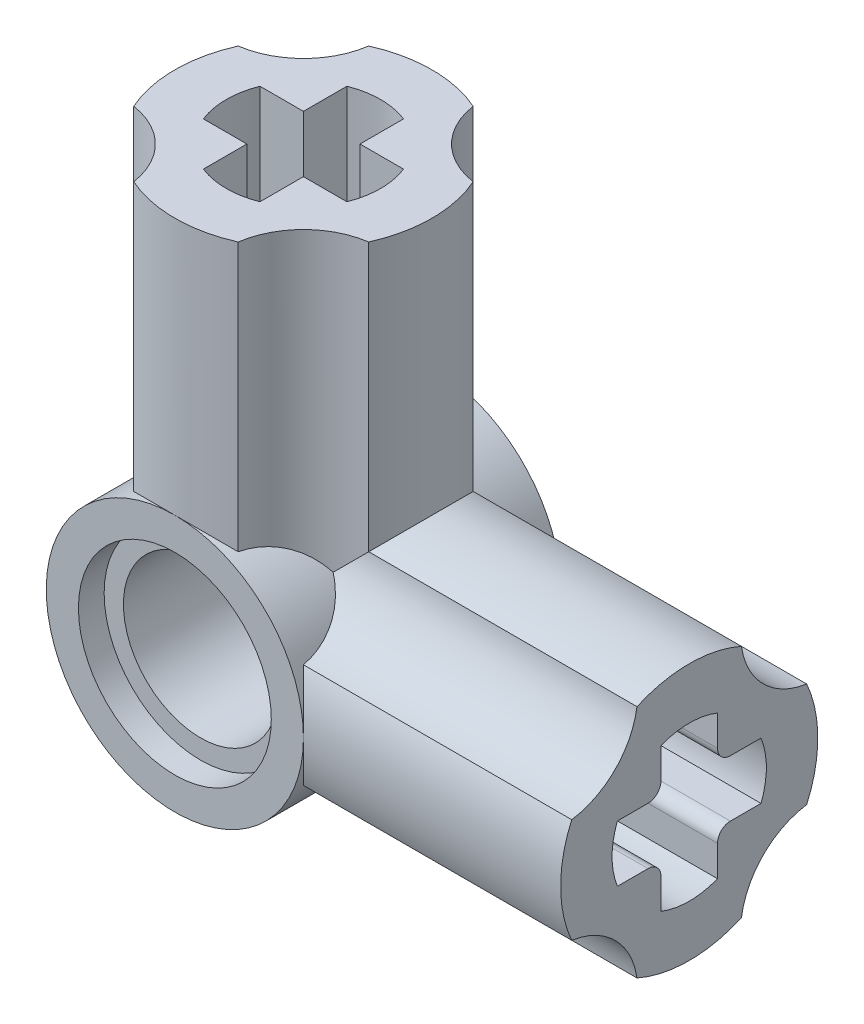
ISO-10303-21;
HEADER;
FILE_DESCRIPTION(('STEP AP214'),'2;1');
FILE_NAME('part.step','',(''),(''),'','','');
FILE_SCHEMA(('AUTOMOTIVE_DESIGN { 1 0 10303 214 1 1 1 1 }'));
ENDSEC;
DATA;
#1=APPLICATION_CONTEXT('core data for automotive mechanical design processes');
#2=APPLICATION_PROTOCOL_DEFINITION('international standard','automotive_design',2000,#1);
#3=PRODUCT_CONTEXT('',#1,'mechanical');
#4=PRODUCT('Part','Part','',(#3));
#5=PRODUCT_RELATED_PRODUCT_CATEGORY('part','',(#4));
#6=PRODUCT_DEFINITION_FORMATION('','',#4);
#7=PRODUCT_DEFINITION_CONTEXT('part definition',#1,'design');
#8=PRODUCT_DEFINITION('design','',#6,#7);
#9=PRODUCT_DEFINITION_SHAPE('','',#8);
#10=(LENGTH_UNIT() NAMED_UNIT(*) SI_UNIT(.MILLI.,.METRE.));
#11=(NAMED_UNIT(*) PLANE_ANGLE_UNIT() SI_UNIT($,.RADIAN.));
#12=(NAMED_UNIT(*) SI_UNIT($,.STERADIAN.) SOLID_ANGLE_UNIT());
#13=UNCERTAINTY_MEASURE_WITH_UNIT(LENGTH_MEASURE(1.E-05),#10,'distance_accuracy_value','');
#14=(GEOMETRIC_REPRESENTATION_CONTEXT(3) GLOBAL_UNCERTAINTY_ASSIGNED_CONTEXT((#13)) GLOBAL_UNIT_ASSIGNED_CONTEXT((#10,
#11,#12)) REPRESENTATION_CONTEXT('',''));
#15=CARTESIAN_POINT('',(0.,0.,0.));
#16=DIRECTION('',(0.,0.,1.));
#17=DIRECTION('',(1.,0.,0.));
#18=AXIS2_PLACEMENT_3D('',#15,#16,#17);
#19=CARTESIAN_POINT('',(-12.,0.,-4.));
#20=DIRECTION('',(0.,0.,1.));
#21=DIRECTION('',(1.,0.,0.));
#22=AXIS2_PLACEMENT_3D('',#19,#20,#21);
#23=CYLINDRICAL_SURFACE('',#22,4.);
#24=CARTESIAN_POINT('',(-12.,0.,0.));
#25=DIRECTION('',(0.,0.707106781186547,0.707106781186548));
#26=DIRECTION('',(0.,0.707106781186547,-0.707106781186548));
#27=AXIS2_PLACEMENT_3D('',#24,#25,#26);
#28=ELLIPSE('',#27,5.65685424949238,4.);
#29=CARTESIAN_POINT('',(-10.375086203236,3.65508620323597,-3.65508620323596));
#30=VERTEX_POINT('',#29);
#31=CARTESIAN_POINT('',(-12.,4.,-4.));
#32=VERTEX_POINT('',#31);
#33=EDGE_CURVE('E723',#30,#32,#28,.T.);
#34=ORIENTED_EDGE('',*,*,#33,.F.);
#35=CARTESIAN_POINT('',(-8.34491379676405,1.62491379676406,-1.62491379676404));
#36=CARTESIAN_POINT('',(-8.38612811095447,1.71768608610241,-1.63092923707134));
#37=CARTESIAN_POINT('',(-8.43090422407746,1.80882905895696,-1.63849926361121));
#38=CARTESIAN_POINT('',(-8.52712899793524,1.98731420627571,-1.65807936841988));
#39=CARTESIAN_POINT('',(-8.57859420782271,2.07464621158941,-1.67010060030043));
#40=CARTESIAN_POINT('',(-8.68790987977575,2.24507986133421,-1.70000011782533));
#41=CARTESIAN_POINT('',(-8.74580211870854,2.32814799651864,-1.71791841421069));
#42=CARTESIAN_POINT('',(-8.86662896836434,2.48838222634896,-1.76101246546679));
#43=CARTESIAN_POINT('',(-8.92955712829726,2.56555563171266,-1.78617903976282));
#44=CARTESIAN_POINT('',(-9.07974858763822,2.73656873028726,-1.85455544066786));
#45=CARTESIAN_POINT('',(-9.16841207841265,2.8279563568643,-1.90095472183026));
#46=CARTESIAN_POINT('',(-9.3476143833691,2.99664961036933,-2.01130610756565));
#47=CARTESIAN_POINT('',(-9.43814385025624,3.07401229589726,-2.07518430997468));
#48=CARTESIAN_POINT('',(-9.57155892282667,3.17898592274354,-2.18517706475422));
#49=CARTESIAN_POINT('',(-9.61581178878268,3.21224613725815,-2.22439555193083));
#50=CARTESIAN_POINT('',(-9.70264060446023,3.27490362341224,-2.30748194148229));
#51=CARTESIAN_POINT('',(-9.74521726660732,3.30430254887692,-2.35134783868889));
#52=CARTESIAN_POINT('',(-9.8279916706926,3.35929414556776,-2.44362830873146));
#53=CARTESIAN_POINT('',(-9.8681859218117,3.38488131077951,-2.49204929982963));
#54=CARTESIAN_POINT('',(-9.94539497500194,3.43229516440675,-2.5930577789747));
#55=CARTESIAN_POINT('',(-9.98241010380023,3.45412223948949,-2.64564483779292));
#56=CARTESIAN_POINT('',(-10.0809776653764,3.51037034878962,-2.79865941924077));
#57=CARTESIAN_POINT('',(-10.138221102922,3.54073693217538,-2.9034421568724));
#58=CARTESIAN_POINT('',(-10.236986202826,3.59094434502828,-3.12233368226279));
#59=CARTESIAN_POINT('',(-10.2785283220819,3.6107988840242,-3.23643009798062));
#60=CARTESIAN_POINT('',(-10.3250988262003,3.63248214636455,-3.40287021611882));
#61=CARTESIAN_POINT('',(-10.3373575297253,3.63809839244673,-3.4528132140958));
#62=CARTESIAN_POINT('',(-10.3586461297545,3.64775146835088,-3.55343145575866));
#63=CARTESIAN_POINT('',(-10.3676822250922,3.65179133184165,-3.60410509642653));
#64=CARTESIAN_POINT('',(-10.375086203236,3.65508620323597,-3.65508620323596));
#65=B_SPLINE_CURVE_WITH_KNOTS('',3,(#35,#36,#37,#38,#39,#40,#41,#42,#43,#44,#45,#46,#47,#48,#49,
#50,#51,#52,#53,#54,#55,#56,#57,#58,#59,#60,#61,#62,#63,#64),.UNSPECIFIED.,.F.,.F.,(4,2,2,2,2,2,
2,2,2,2,2,2,2,2,4),(0.,0.305068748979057,0.610907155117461,0.918864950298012,1.22643439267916,
1.63131432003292,2.03450815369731,2.23779057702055,2.44098564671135,2.64447143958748,
2.84793629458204,3.21562348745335,3.58282996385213,3.73791688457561,3.89270385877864),.UNSPECIFIED.);
#66=CARTESIAN_POINT('',(-9.17157287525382,2.8284271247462,-1.90538380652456));
#67=VERTEX_POINT('',#66);
#68=EDGE_CURVE('E724',#67,#30,#65,.T.);
#69=ORIENTED_EDGE('',*,*,#68,.F.);
#70=CARTESIAN_POINT('',(-10.375086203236,3.65508620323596,-1.62491379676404));
#71=CARTESIAN_POINT('',(-10.2823139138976,3.61387188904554,-1.63092923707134));
#72=CARTESIAN_POINT('',(-10.1911709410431,3.56909577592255,-1.63849926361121));
#73=CARTESIAN_POINT('',(-10.0126857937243,3.47287100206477,-1.65807936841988));
#74=CARTESIAN_POINT('',(-9.92535378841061,3.4214057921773,-1.67010060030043));
#75=CARTESIAN_POINT('',(-9.75492013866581,3.31209012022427,-1.70000011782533));
#76=CARTESIAN_POINT('',(-9.67185200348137,3.25419788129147,-1.71791841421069));
#77=CARTESIAN_POINT('',(-9.51161777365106,3.13337103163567,-1.76101246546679));
#78=CARTESIAN_POINT('',(-9.43444436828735,3.07044287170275,-1.78617903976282));
#79=CARTESIAN_POINT('',(-9.26343126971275,2.92025141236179,-1.85455544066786));
#80=CARTESIAN_POINT('',(-9.17204364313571,2.83158792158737,-1.90095472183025));
#81=CARTESIAN_POINT('',(-9.00335038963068,2.65238561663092,-2.01130610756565));
#82=CARTESIAN_POINT('',(-8.92598770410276,2.56185614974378,-2.07518430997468));
#83=CARTESIAN_POINT('',(-8.82101407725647,2.42844107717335,-2.18517706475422));
#84=CARTESIAN_POINT('',(-8.78775386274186,2.38418821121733,-2.22439555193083));
#85=CARTESIAN_POINT('',(-8.72509637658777,2.29735939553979,-2.30748194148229));
#86=CARTESIAN_POINT('',(-8.6956974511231,2.2547827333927,-2.35134783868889));
#87=CARTESIAN_POINT('',(-8.64070585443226,2.17200832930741,-2.44362830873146));
#88=CARTESIAN_POINT('',(-8.6151186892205,2.13181407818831,-2.49204929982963));
#89=CARTESIAN_POINT('',(-8.56770483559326,2.05460502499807,-2.5930577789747));
#90=CARTESIAN_POINT('',(-8.54587776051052,2.01758989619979,-2.64564483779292));
#91=CARTESIAN_POINT('',(-8.48962965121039,1.91902233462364,-2.79865941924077));
#92=CARTESIAN_POINT('',(-8.45926306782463,1.86177889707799,-2.9034421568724));
#93=CARTESIAN_POINT('',(-8.40905565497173,1.76301379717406,-3.12233368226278));
#94=CARTESIAN_POINT('',(-8.38920111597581,1.72147167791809,-3.23643009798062));
#95=CARTESIAN_POINT('',(-8.36751785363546,1.67490117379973,-3.40287021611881));
#96=CARTESIAN_POINT('',(-8.36190160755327,1.6626424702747,-3.4528132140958));
#97=CARTESIAN_POINT('',(-8.35224853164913,1.6413538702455,-3.55343145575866));
#98=CARTESIAN_POINT('',(-8.34820866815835,1.63231777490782,-3.60410509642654));
#99=CARTESIAN_POINT('',(-8.34491379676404,1.62491379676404,-3.65508620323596));
#100=B_SPLINE_CURVE_WITH_KNOTS('',3,(#70,#71,#72,#73,#74,#75,#76,#77,#78,#79,#80,#81,#82,#83,
#84,#85,#86,#87,#88,#89,#90,#91,#92,#93,#94,#95,#96,#97,#98,#99),.UNSPECIFIED.,.F.,.F.,(4,2,2,2,
2,2,2,2,2,2,2,2,2,2,4),(0.,0.305068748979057,0.61090715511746,0.918864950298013,
1.22643439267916,1.63131432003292,2.03450815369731,2.23779057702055,2.44098564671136,
2.64447143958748,2.84793629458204,3.21562348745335,3.58282996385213,3.73791688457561,
3.89270385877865),.UNSPECIFIED.);
#101=CARTESIAN_POINT('',(-8.34491379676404,1.62491379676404,-3.65508620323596));
#102=VERTEX_POINT('',#101);
#103=EDGE_CURVE('E470',#67,#102,#100,.T.);
#104=ORIENTED_EDGE('',*,*,#103,.T.);
#105=CARTESIAN_POINT('',(-12.,0.,0.));
#106=DIRECTION('',(0.707106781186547,0.,0.707106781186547));
#107=DIRECTION('',(0.707106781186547,0.,-0.707106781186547));
#108=AXIS2_PLACEMENT_3D('',#105,#106,#107);
#109=ELLIPSE('',#108,5.65685424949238,4.);
#110=CARTESIAN_POINT('',(-8.,0.,-4.));
#111=VERTEX_POINT('',#110);
#112=EDGE_CURVE('E564',#102,#111,#109,.F.);
#113=ORIENTED_EDGE('',*,*,#112,.T.);
#114=CARTESIAN_POINT('',(-12.,0.,-4.));
#115=DIRECTION('',(0.,0.,1.));
#116=DIRECTION('',(1.,0.,0.));
#117=AXIS2_PLACEMENT_3D('',#114,#115,#116);
#118=CIRCLE('',#117,4.);
#119=EDGE_CURVE('E626',#111,#32,#118,.T.);
#120=ORIENTED_EDGE('',*,*,#119,.T.);
#121=EDGE_LOOP('',(#34,#69,#104,#113,#120));
#122=FACE_BOUND('',#121,.T.);
#123=ADVANCED_FACE('F36',(#122),#23,.T.);
#124=CARTESIAN_POINT('',(-8.34491379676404,1.62491379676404,3.65508620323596));
#125=CARTESIAN_POINT('',(-8.3488076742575,1.63365001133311,3.59486576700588));
#126=CARTESIAN_POINT('',(-8.35374090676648,1.64468450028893,3.53504696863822));
#127=CARTESIAN_POINT('',(-8.36580861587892,1.67119258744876,3.41662458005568));
#128=CARTESIAN_POINT('',(-8.37294319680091,1.68666639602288,3.35802104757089));
#129=CARTESIAN_POINT('',(-8.38953041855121,1.72188341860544,3.24248433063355));
#130=CARTESIAN_POINT('',(-8.39898155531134,1.74162386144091,3.18555008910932));
#131=CARTESIAN_POINT('',(-8.42034957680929,1.78513025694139,3.07373991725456));
#132=CARTESIAN_POINT('',(-8.4322663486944,1.80889602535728,3.0188638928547));
#133=CARTESIAN_POINT('',(-8.4720037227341,1.88589257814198,2.85777764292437));
#134=CARTESIAN_POINT('',(-8.50380523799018,1.94480861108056,2.75515449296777));
#135=CARTESIAN_POINT('',(-8.57916850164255,2.07448831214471,2.56268164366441));
#136=CARTESIAN_POINT('',(-8.62272229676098,2.14524395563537,2.47282336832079));
#137=CARTESIAN_POINT('',(-8.72181458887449,2.29376630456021,2.30858168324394));
#138=CARTESIAN_POINT('',(-8.7772230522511,2.37145199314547,2.2340463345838));
#139=CARTESIAN_POINT('',(-8.90015898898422,2.53002759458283,2.10000614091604));
#140=CARTESIAN_POINT('',(-8.96768565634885,2.61091729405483,2.0405002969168));
#141=CARTESIAN_POINT('',(-9.11744135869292,2.77557544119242,1.93338471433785));
#142=CARTESIAN_POINT('',(-9.20021716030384,2.85929767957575,1.88647591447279));
#143=CARTESIAN_POINT('',(-9.37668242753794,3.02202717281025,1.80641185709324));
#144=CARTESIAN_POINT('',(-9.47039743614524,3.10102271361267,1.77328964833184));
#145=CARTESIAN_POINT('',(-9.63000037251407,3.22321618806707,1.72863096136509));
#146=CARTESIAN_POINT('',(-9.69319824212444,3.26875895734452,1.71365358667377));
#147=CARTESIAN_POINT('',(-9.82271881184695,3.35642029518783,1.68744785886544));
#148=CARTESIAN_POINT('',(-9.88904285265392,3.39853737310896,1.67622113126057));
#149=CARTESIAN_POINT('',(-10.024041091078,3.47875259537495,1.65692530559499));
#150=CARTESIAN_POINT('',(-10.0927016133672,3.51687009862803,1.64884043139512));
#151=CARTESIAN_POINT('',(-10.2322762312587,3.58905785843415,1.63516177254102));
#152=CARTESIAN_POINT('',(-10.3031880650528,3.62313202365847,1.62956556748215));
#153=CARTESIAN_POINT('',(-10.375086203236,3.65508620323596,1.62491379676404));
#154=B_SPLINE_CURVE_WITH_KNOTS('',3,(#124,#125,#126,#127,#128,#129,#130,#131,#132,#133,#134,
#135,#136,#137,#138,#139,#140,#141,#142,#143,#144,#145,#146,#147,#148,#149,#150,#151,#152,#153),
.UNSPECIFIED.,.F.,.F.,(4,2,2,2,2,2,2,2,2,2,2,2,2,2,4),(0.,0.182870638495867,0.365749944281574,
0.548510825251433,0.73126334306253,1.09690984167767,1.46230950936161,1.82388969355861,
2.18544583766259,2.56420913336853,2.9438752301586,3.18164590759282,3.41951950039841,
3.65618273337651,3.89261528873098),.UNSPECIFIED.);
#155=CARTESIAN_POINT('',(-8.34491379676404,1.62491379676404,3.65508620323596));
#156=VERTEX_POINT('',#155);
#157=CARTESIAN_POINT('',(-9.17157287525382,2.8284271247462,1.90538380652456));
#158=VERTEX_POINT('',#157);
#159=EDGE_CURVE('E521',#156,#158,#154,.T.);
#160=ORIENTED_EDGE('',*,*,#159,.T.);
#161=CARTESIAN_POINT('',(-10.375086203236,3.65508620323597,3.65508620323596));
#162=CARTESIAN_POINT('',(-10.3663499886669,3.6511923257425,3.59486576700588));
#163=CARTESIAN_POINT('',(-10.3553154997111,3.64625909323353,3.53504696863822));
#164=CARTESIAN_POINT('',(-10.3288074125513,3.63419138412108,3.41662458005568));
#165=CARTESIAN_POINT('',(-10.3133336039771,3.6270568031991,3.35802104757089));
#166=CARTESIAN_POINT('',(-10.2781165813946,3.6104695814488,3.24248433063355));
#167=CARTESIAN_POINT('',(-10.2583761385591,3.60101844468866,3.18555008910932));
#168=CARTESIAN_POINT('',(-10.2148697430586,3.57965042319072,3.07373991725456));
#169=CARTESIAN_POINT('',(-10.1911039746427,3.56773365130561,3.0188638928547));
#170=CARTESIAN_POINT('',(-10.114107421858,3.52799627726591,2.85777764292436));
#171=CARTESIAN_POINT('',(-10.0551913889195,3.49619476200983,2.75515449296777));
#172=CARTESIAN_POINT('',(-9.92551168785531,3.42083149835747,2.56268164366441));
#173=CARTESIAN_POINT('',(-9.85475604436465,3.37727770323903,2.47282336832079));
#174=CARTESIAN_POINT('',(-9.70623369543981,3.27818541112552,2.30858168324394));
#175=CARTESIAN_POINT('',(-9.62854800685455,3.22277694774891,2.2340463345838));
#176=CARTESIAN_POINT('',(-9.46997240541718,3.09984101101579,2.10000614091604));
#177=CARTESIAN_POINT('',(-9.38908270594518,3.03231434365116,2.0405002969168));
#178=CARTESIAN_POINT('',(-9.22442455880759,2.88255864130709,1.93338471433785));
#179=CARTESIAN_POINT('',(-9.14070232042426,2.79978283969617,1.88647591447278));
#180=CARTESIAN_POINT('',(-8.97797282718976,2.62331757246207,1.80641185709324));
#181=CARTESIAN_POINT('',(-8.89897728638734,2.52960256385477,1.77328964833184));
#182=CARTESIAN_POINT('',(-8.77678381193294,2.36999962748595,1.72863096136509));
#183=CARTESIAN_POINT('',(-8.73124104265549,2.30680175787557,1.71365358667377));
#184=CARTESIAN_POINT('',(-8.64357970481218,2.17728118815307,1.68744785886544));
#185=CARTESIAN_POINT('',(-8.60146262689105,2.11095714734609,1.67622113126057));
#186=CARTESIAN_POINT('',(-8.52124740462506,1.97595890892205,1.65692530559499));
#187=CARTESIAN_POINT('',(-8.48312990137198,1.90729838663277,1.64884043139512));
#188=CARTESIAN_POINT('',(-8.41094214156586,1.76772376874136,1.63516177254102));
#189=CARTESIAN_POINT('',(-8.37686797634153,1.69681193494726,1.62956556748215));
#190=CARTESIAN_POINT('',(-8.34491379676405,1.62491379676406,1.62491379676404));
#191=B_SPLINE_CURVE_WITH_KNOTS('',3,(#161,#162,#163,#164,#165,#166,#167,#168,#169,#170,#171,
#172,#173,#174,#175,#176,#177,#178,#179,#180,#181,#182,#183,#184,#185,#186,#187,#188,#189,#190),
.UNSPECIFIED.,.F.,.F.,(4,2,2,2,2,2,2,2,2,2,2,2,2,2,4),(0.,0.182870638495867,0.365749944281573,
0.548510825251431,0.73126334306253,1.09690984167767,1.46230950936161,1.82388969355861,
2.18544583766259,2.56420913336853,2.94387523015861,3.18164590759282,3.41951950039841,
3.65618273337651,3.89261528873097),.UNSPECIFIED.);
#192=CARTESIAN_POINT('',(-10.375086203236,3.65508620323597,3.65508620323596));
#193=VERTEX_POINT('',#192);
#194=EDGE_CURVE('E436',#193,#158,#191,.T.);
#195=ORIENTED_EDGE('',*,*,#194,.F.);
#196=CARTESIAN_POINT('',(-12.,0.,0.));
#197=DIRECTION('',(0.,0.707106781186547,-0.707106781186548));
#198=DIRECTION('',(0.,0.707106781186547,0.707106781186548));
#199=AXIS2_PLACEMENT_3D('',#196,#197,#198);
#200=ELLIPSE('',#199,5.65685424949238,4.);
#201=CARTESIAN_POINT('',(-12.,4.,4.));
#202=VERTEX_POINT('',#201);
#203=EDGE_CURVE('E765',#202,#193,#200,.T.);
#204=ORIENTED_EDGE('',*,*,#203,.F.);
#205=CARTESIAN_POINT('',(-12.,0.,4.));
#206=DIRECTION('',(0.,0.,1.));
#207=DIRECTION('',(1.,0.,0.));
#208=AXIS2_PLACEMENT_3D('',#205,#206,#207);
#209=CIRCLE('',#208,4.);
#210=CARTESIAN_POINT('',(-8.,0.,4.));
#211=VERTEX_POINT('',#210);
#212=EDGE_CURVE('E622',#211,#202,#209,.T.);
#213=ORIENTED_EDGE('',*,*,#212,.F.);
#214=CARTESIAN_POINT('',(-12.,0.,0.));
#215=DIRECTION('',(0.707106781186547,0.,-0.707106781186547));
#216=DIRECTION('',(0.707106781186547,0.,0.707106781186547));
#217=AXIS2_PLACEMENT_3D('',#214,#215,#216);
#218=ELLIPSE('',#217,5.65685424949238,4.);
#219=EDGE_CURVE('E535',#211,#156,#218,.F.);
#220=ORIENTED_EDGE('',*,*,#219,.T.);
#221=EDGE_LOOP('',(#160,#195,#204,#213,#220));
#222=FACE_BOUND('',#221,.T.);
#223=ADVANCED_FACE('F716',(#222),#23,.T.);
#224=EDGE_CURVE('E625',#202,#211,#209,.T.);
#225=ORIENTED_EDGE('',*,*,#224,.F.);
#226=CARTESIAN_POINT('',(-13.6249137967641,3.65508620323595,3.65508620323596));
#227=VERTEX_POINT('',#226);
#228=EDGE_CURVE('E369',#227,#202,#200,.T.);
#229=ORIENTED_EDGE('',*,*,#228,.F.);
#230=CARTESIAN_POINT('',(-15.655086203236,1.62491379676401,1.62491379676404));
#231=CARTESIAN_POINT('',(-15.6138718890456,1.71768608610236,1.63092923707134));
#232=CARTESIAN_POINT('',(-15.5690957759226,1.80882905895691,1.63849926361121));
#233=CARTESIAN_POINT('',(-15.4728710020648,1.98731420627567,1.65807936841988));
#234=CARTESIAN_POINT('',(-15.4214057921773,2.07464621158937,1.67010060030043));
#235=CARTESIAN_POINT('',(-15.3120901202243,2.24507986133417,1.70000011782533));
#236=CARTESIAN_POINT('',(-15.2541978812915,2.3281479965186,1.71791841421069));
#237=CARTESIAN_POINT('',(-15.1333710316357,2.48838222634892,1.76101246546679));
#238=CARTESIAN_POINT('',(-15.0704428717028,2.56555563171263,1.78617903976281));
#239=CARTESIAN_POINT('',(-14.9202514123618,2.73656873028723,1.85455544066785));
#240=CARTESIAN_POINT('',(-14.8315879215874,2.82795635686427,1.90095472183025));
#241=CARTESIAN_POINT('',(-14.6523856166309,2.9966496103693,2.01130610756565));
#242=CARTESIAN_POINT('',(-14.5618561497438,3.07401229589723,2.07518430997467));
#243=CARTESIAN_POINT('',(-14.4284410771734,3.17898592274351,2.18517706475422));
#244=CARTESIAN_POINT('',(-14.3841882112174,3.21224613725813,2.22439555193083));
#245=CARTESIAN_POINT('',(-14.2973593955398,3.27490362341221,2.30748194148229));
#246=CARTESIAN_POINT('',(-14.2547827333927,3.30430254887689,2.35134783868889));
#247=CARTESIAN_POINT('',(-14.1720083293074,3.35929414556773,2.44362830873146));
#248=CARTESIAN_POINT('',(-14.1318140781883,3.38488131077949,2.49204929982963));
#249=CARTESIAN_POINT('',(-14.0546050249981,3.43229516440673,2.5930577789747));
#250=CARTESIAN_POINT('',(-14.0175898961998,3.45412223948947,2.64564483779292));
#251=CARTESIAN_POINT('',(-13.9190223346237,3.5103703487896,2.79865941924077));
#252=CARTESIAN_POINT('',(-13.861778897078,3.54073693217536,2.9034421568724));
#253=CARTESIAN_POINT('',(-13.7630137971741,3.59094434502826,3.12233368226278));
#254=CARTESIAN_POINT('',(-13.7214716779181,3.61079888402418,3.23643009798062));
#255=CARTESIAN_POINT('',(-13.6749011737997,3.63248214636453,3.40287021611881));
#256=CARTESIAN_POINT('',(-13.6626424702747,3.63809839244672,3.4528132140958));
#257=CARTESIAN_POINT('',(-13.6413538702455,3.64775146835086,3.55343145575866));
#258=CARTESIAN_POINT('',(-13.6323177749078,3.65179133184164,3.60410509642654));
#259=CARTESIAN_POINT('',(-13.6249137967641,3.65508620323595,3.65508620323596));
#260=B_SPLINE_CURVE_WITH_KNOTS('',3,(#230,#231,#232,#233,#234,#235,#236,#237,#238,#239,#240,
#241,#242,#243,#244,#245,#246,#247,#248,#249,#250,#251,#252,#253,#254,#255,#256,#257,#258,#259),
.UNSPECIFIED.,.F.,.F.,(4,2,2,2,2,2,2,2,2,2,2,2,2,2,4),(0.,0.305068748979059,0.610907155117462,
0.918864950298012,1.22643439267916,1.63131432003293,2.03450815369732,2.23779057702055,
2.44098564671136,2.64447143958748,2.84793629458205,3.21562348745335,3.58282996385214,
3.73791688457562,3.89270385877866),.UNSPECIFIED.);
#261=CARTESIAN_POINT('',(-15.655086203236,1.62491379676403,1.62491379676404));
#262=VERTEX_POINT('',#261);
#263=EDGE_CURVE('E350',#262,#227,#260,.T.);
#264=ORIENTED_EDGE('',*,*,#263,.F.);
#265=CARTESIAN_POINT('',(-12.,0.,0.));
#266=DIRECTION('',(0.,0.707106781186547,-0.707106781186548));
#267=DIRECTION('',(0.,0.707106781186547,0.707106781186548));
#268=AXIS2_PLACEMENT_3D('',#265,#266,#267);
#269=ELLIPSE('',#268,5.65685424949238,4.);
#270=CARTESIAN_POINT('',(-16.,0.,0.));
#271=VERTEX_POINT('',#270);
#272=EDGE_CURVE('E358',#271,#262,#269,.T.);
#273=ORIENTED_EDGE('',*,*,#272,.F.);
#274=CARTESIAN_POINT('',(-12.,0.,0.));
#275=DIRECTION('',(0.,0.707106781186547,0.707106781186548));
#276=DIRECTION('',(0.,0.707106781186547,-0.707106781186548));
#277=AXIS2_PLACEMENT_3D('',#274,#275,#276);
#278=ELLIPSE('',#277,5.65685424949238,4.);
#279=CARTESIAN_POINT('',(-15.655086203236,1.62491379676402,-1.62491379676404));
#280=VERTEX_POINT('',#279);
#281=EDGE_CURVE('E364',#280,#271,#278,.T.);
#282=ORIENTED_EDGE('',*,*,#281,.F.);
#283=CARTESIAN_POINT('',(-13.6249137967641,3.65508620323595,-3.65508620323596));
#284=CARTESIAN_POINT('',(-13.6336500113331,3.65119232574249,-3.59486576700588));
#285=CARTESIAN_POINT('',(-13.6446845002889,3.64625909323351,-3.53504696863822));
#286=CARTESIAN_POINT('',(-13.6711925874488,3.63419138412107,-3.41662458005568));
#287=CARTESIAN_POINT('',(-13.6866663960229,3.62705680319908,-3.35802104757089));
#288=CARTESIAN_POINT('',(-13.7218834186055,3.61046958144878,-3.24248433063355));
#289=CARTESIAN_POINT('',(-13.7416238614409,3.60101844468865,-3.18555008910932));
#290=CARTESIAN_POINT('',(-13.7851302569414,3.5796504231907,-3.07373991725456));
#291=CARTESIAN_POINT('',(-13.8088960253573,3.56773365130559,-3.0188638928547));
#292=CARTESIAN_POINT('',(-13.885892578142,3.52799627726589,-2.85777764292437));
#293=CARTESIAN_POINT('',(-13.9448086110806,3.49619476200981,-2.75515449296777));
#294=CARTESIAN_POINT('',(-14.0744883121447,3.42083149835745,-2.56268164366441));
#295=CARTESIAN_POINT('',(-14.1452439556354,3.37727770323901,-2.47282336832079));
#296=CARTESIAN_POINT('',(-14.2937663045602,3.2781854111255,-2.30858168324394));
#297=CARTESIAN_POINT('',(-14.3714519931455,3.22277694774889,-2.2340463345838));
#298=CARTESIAN_POINT('',(-14.5300275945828,3.09984101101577,-2.10000614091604));
#299=CARTESIAN_POINT('',(-14.6109172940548,3.03231434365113,-2.0405002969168));
#300=CARTESIAN_POINT('',(-14.7755754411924,2.88255864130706,-1.93338471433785));
#301=CARTESIAN_POINT('',(-14.8592976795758,2.79978283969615,-1.88647591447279));
#302=CARTESIAN_POINT('',(-15.0220271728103,2.62331757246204,-1.80641185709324));
#303=CARTESIAN_POINT('',(-15.1010227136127,2.52960256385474,-1.77328964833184));
#304=CARTESIAN_POINT('',(-15.2232161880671,2.36999962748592,-1.72863096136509));
#305=CARTESIAN_POINT('',(-15.2687589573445,2.30680175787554,-1.71365358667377));
#306=CARTESIAN_POINT('',(-15.3564202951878,2.17728118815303,-1.68744785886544));
#307=CARTESIAN_POINT('',(-15.398537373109,2.11095714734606,-1.67622113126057));
#308=CARTESIAN_POINT('',(-15.478752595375,1.97595890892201,-1.65692530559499));
#309=CARTESIAN_POINT('',(-15.516870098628,1.90729838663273,-1.64884043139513));
#310=CARTESIAN_POINT('',(-15.5890578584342,1.76772376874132,-1.63516177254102));
#311=CARTESIAN_POINT('',(-15.6231320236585,1.69681193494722,-1.62956556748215));
#312=CARTESIAN_POINT('',(-15.655086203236,1.62491379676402,-1.62491379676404));
#313=B_SPLINE_CURVE_WITH_KNOTS('',3,(#283,#284,#285,#286,#287,#288,#289,#290,#291,#292,#293,
#294,#295,#296,#297,#298,#299,#300,#301,#302,#303,#304,#305,#306,#307,#308,#309,#310,#311,#312),
.UNSPECIFIED.,.F.,.F.,(4,2,2,2,2,2,2,2,2,2,2,2,2,2,4),(0.,0.182870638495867,0.365749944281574,
0.548510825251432,0.731263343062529,1.09690984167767,1.4623095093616,1.82388969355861,
2.18544583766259,2.56420913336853,2.9438752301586,3.18164590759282,3.41951950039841,
3.65618273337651,3.89261528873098),.UNSPECIFIED.);
#314=CARTESIAN_POINT('',(-13.6249137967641,3.65508620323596,-3.65508620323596));
#315=VERTEX_POINT('',#314);
#316=EDGE_CURVE('E400',#315,#280,#313,.T.);
#317=ORIENTED_EDGE('',*,*,#316,.F.);
#318=EDGE_CURVE('E729',#32,#315,#28,.T.);
#319=ORIENTED_EDGE('',*,*,#318,.F.);
#320=EDGE_CURVE('E577',#32,#111,#118,.T.);
#321=ORIENTED_EDGE('',*,*,#320,.T.);
#322=CARTESIAN_POINT('',(-8.34491379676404,-1.62491379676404,-3.65508620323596));
#323=VERTEX_POINT('',#322);
#324=EDGE_CURVE('E478',#111,#323,#109,.F.);
#325=ORIENTED_EDGE('',*,*,#324,.T.);
#326=CARTESIAN_POINT('',(-8.34491379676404,-1.62491379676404,-3.65508620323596));
#327=CARTESIAN_POINT('',(-8.3488076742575,-1.63365001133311,-3.59486576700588));
#328=CARTESIAN_POINT('',(-8.35374090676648,-1.64468450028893,-3.53504696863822));
#329=CARTESIAN_POINT('',(-8.36580861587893,-1.67119258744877,-3.41662458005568));
#330=CARTESIAN_POINT('',(-8.37294319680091,-1.68666639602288,-3.35802104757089));
#331=CARTESIAN_POINT('',(-8.38953041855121,-1.72188341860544,-3.24248433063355));
#332=CARTESIAN_POINT('',(-8.39898155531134,-1.74162386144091,-3.18555008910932));
#333=CARTESIAN_POINT('',(-8.42034957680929,-1.78513025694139,-3.07373991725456));
#334=CARTESIAN_POINT('',(-8.4322663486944,-1.80889602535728,-3.0188638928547));
#335=CARTESIAN_POINT('',(-8.4720037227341,-1.88589257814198,-2.85777764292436));
#336=CARTESIAN_POINT('',(-8.50380523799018,-1.94480861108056,-2.75515449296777));
#337=CARTESIAN_POINT('',(-8.57916850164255,-2.07448831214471,-2.56268164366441));
#338=CARTESIAN_POINT('',(-8.62272229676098,-2.14524395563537,-2.47282336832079));
#339=CARTESIAN_POINT('',(-8.72181458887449,-2.29376630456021,-2.30858168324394));
#340=CARTESIAN_POINT('',(-8.7772230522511,-2.37145199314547,-2.2340463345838));
#341=CARTESIAN_POINT('',(-8.90015898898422,-2.53002759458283,-2.10000614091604));
#342=CARTESIAN_POINT('',(-8.96768565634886,-2.61091729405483,-2.0405002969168));
#343=CARTESIAN_POINT('',(-9.11744135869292,-2.77557544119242,-1.93338471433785));
#344=CARTESIAN_POINT('',(-9.20021716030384,-2.85929767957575,-1.88647591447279));
#345=CARTESIAN_POINT('',(-9.37668242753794,-3.02202717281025,-1.80641185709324));
#346=CARTESIAN_POINT('',(-9.47039743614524,-3.10102271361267,-1.77328964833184));
#347=CARTESIAN_POINT('',(-9.63000037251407,-3.22321618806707,-1.72863096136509));
#348=CARTESIAN_POINT('',(-9.69319824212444,-3.26875895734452,-1.71365358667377));
#349=CARTESIAN_POINT('',(-9.82271881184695,-3.35642029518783,-1.68744785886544));
#350=CARTESIAN_POINT('',(-9.88904285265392,-3.39853737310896,-1.67622113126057));
#351=CARTESIAN_POINT('',(-10.024041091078,-3.47875259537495,-1.65692530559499));
#352=CARTESIAN_POINT('',(-10.0927016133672,-3.51687009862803,-1.64884043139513));
#353=CARTESIAN_POINT('',(-10.2322762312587,-3.58905785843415,-1.63516177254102));
#354=CARTESIAN_POINT('',(-10.3031880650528,-3.62313202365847,-1.62956556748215));
#355=CARTESIAN_POINT('',(-10.375086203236,-3.65508620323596,-1.62491379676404));
#356=B_SPLINE_CURVE_WITH_KNOTS('',3,(#326,#327,#328,#329,#330,#331,#332,#333,#334,#335,#336,
#337,#338,#339,#340,#341,#342,#343,#344,#345,#346,#347,#348,#349,#350,#351,#352,#353,#354,#355),
.UNSPECIFIED.,.F.,.F.,(4,2,2,2,2,2,2,2,2,2,2,2,2,2,4),(0.,0.182870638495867,0.365749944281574,
0.548510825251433,0.73126334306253,1.09690984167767,1.4623095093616,1.82388969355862,
2.18544583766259,2.56420913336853,2.9438752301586,3.18164590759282,3.4195195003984,
3.6561827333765,3.89261528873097),.UNSPECIFIED.);
#357=CARTESIAN_POINT('',(-10.375086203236,-3.65508620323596,-1.62491379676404));
#358=VERTEX_POINT('',#357);
#359=EDGE_CURVE('E557',#323,#358,#356,.T.);
#360=ORIENTED_EDGE('',*,*,#359,.T.);
#361=CARTESIAN_POINT('',(-12.,0.,0.));
#362=DIRECTION('',(0.707106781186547,0.,0.707106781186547));
#363=DIRECTION('',(0.707106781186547,0.,-0.707106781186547));
#364=AXIS2_PLACEMENT_3D('',#361,#362,#363);
#365=ELLIPSE('',#364,5.65685424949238,4.);
#366=CARTESIAN_POINT('',(-12.,-4.,0.));
#367=VERTEX_POINT('',#366);
#368=EDGE_CURVE('E565',#358,#367,#365,.F.);
#369=ORIENTED_EDGE('',*,*,#368,.T.);
#370=CARTESIAN_POINT('',(-12.,0.,0.));
#371=DIRECTION('',(0.707106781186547,0.,-0.707106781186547));
#372=DIRECTION('',(0.707106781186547,0.,0.707106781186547));
#373=AXIS2_PLACEMENT_3D('',#370,#371,#372);
#374=ELLIPSE('',#373,5.65685424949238,4.);
#375=CARTESIAN_POINT('',(-10.375086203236,-3.65508620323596,1.62491379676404));
#376=VERTEX_POINT('',#375);
#377=EDGE_CURVE('E536',#367,#376,#374,.F.);
#378=ORIENTED_EDGE('',*,*,#377,.T.);
#379=CARTESIAN_POINT('',(-10.375086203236,-3.65508620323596,1.62491379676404));
#380=CARTESIAN_POINT('',(-10.2823139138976,-3.61387188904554,1.63092923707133));
#381=CARTESIAN_POINT('',(-10.1911709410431,-3.56909577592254,1.6384992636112));
#382=CARTESIAN_POINT('',(-10.0126857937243,-3.47287100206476,1.65807936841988));
#383=CARTESIAN_POINT('',(-9.92535378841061,-3.4214057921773,1.67010060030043));
#384=CARTESIAN_POINT('',(-9.7549201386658,-3.31209012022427,1.70000011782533));
#385=CARTESIAN_POINT('',(-9.67185200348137,-3.25419788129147,1.71791841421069));
#386=CARTESIAN_POINT('',(-9.51161777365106,-3.13337103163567,1.76101246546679));
#387=CARTESIAN_POINT('',(-9.43444436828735,-3.07044287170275,1.78617903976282));
#388=CARTESIAN_POINT('',(-9.26343126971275,-2.92025141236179,1.85455544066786));
#389=CARTESIAN_POINT('',(-9.17204364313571,-2.83158792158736,1.90095472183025));
#390=CARTESIAN_POINT('',(-9.00335038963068,-2.65238561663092,2.01130610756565));
#391=CARTESIAN_POINT('',(-8.92598770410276,-2.56185614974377,2.07518430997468));
#392=CARTESIAN_POINT('',(-8.82101407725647,-2.42844107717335,2.18517706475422));
#393=CARTESIAN_POINT('',(-8.78775386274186,-2.38418821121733,2.22439555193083));
#394=CARTESIAN_POINT('',(-8.72509637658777,-2.29735939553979,2.30748194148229));
#395=CARTESIAN_POINT('',(-8.69569745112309,-2.2547827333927,2.35134783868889));
#396=CARTESIAN_POINT('',(-8.64070585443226,-2.17200832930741,2.44362830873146));
#397=CARTESIAN_POINT('',(-8.6151186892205,-2.13181407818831,2.49204929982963));
#398=CARTESIAN_POINT('',(-8.56770483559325,-2.05460502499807,2.5930577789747));
#399=CARTESIAN_POINT('',(-8.54587776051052,-2.01758989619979,2.64564483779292));
#400=CARTESIAN_POINT('',(-8.48962965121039,-1.91902233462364,2.79865941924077));
#401=CARTESIAN_POINT('',(-8.45926306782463,-1.86177889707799,2.9034421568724));
#402=CARTESIAN_POINT('',(-8.40905565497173,-1.76301379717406,3.12233368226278));
#403=CARTESIAN_POINT('',(-8.38920111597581,-1.72147167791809,3.23643009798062));
#404=CARTESIAN_POINT('',(-8.36751785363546,-1.67490117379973,3.40287021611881));
#405=CARTESIAN_POINT('',(-8.36190160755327,-1.6626424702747,3.4528132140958));
#406=CARTESIAN_POINT('',(-8.35224853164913,-1.64135387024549,3.55343145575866));
#407=CARTESIAN_POINT('',(-8.34820866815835,-1.63231777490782,3.60410509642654));
#408=CARTESIAN_POINT('',(-8.34491379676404,-1.62491379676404,3.65508620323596));
#409=B_SPLINE_CURVE_WITH_KNOTS('',3,(#379,#380,#381,#382,#383,#384,#385,#386,#387,#388,#389,
#390,#391,#392,#393,#394,#395,#396,#397,#398,#399,#400,#401,#402,#403,#404,#405,#406,#407,#408),
.UNSPECIFIED.,.F.,.F.,(4,2,2,2,2,2,2,2,2,2,2,2,2,2,4),(0.,0.305068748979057,0.61090715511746,
0.918864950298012,1.22643439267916,1.63131432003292,2.03450815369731,2.23779057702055,
2.44098564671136,2.64447143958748,2.84793629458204,3.21562348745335,3.58282996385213,
3.73791688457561,3.89270385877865),.UNSPECIFIED.);
#410=CARTESIAN_POINT('',(-8.34491379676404,-1.62491379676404,3.65508620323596));
#411=VERTEX_POINT('',#410);
#412=EDGE_CURVE('E528',#376,#411,#409,.T.);
#413=ORIENTED_EDGE('',*,*,#412,.T.);
#414=EDGE_CURVE('E538',#411,#211,#218,.F.);
#415=ORIENTED_EDGE('',*,*,#414,.T.);
#416=EDGE_LOOP('',(#225,#229,#264,#273,#282,#317,#319,#321,#325,#360,#369,#378,#413,#415));
#417=FACE_BOUND('',#416,.T.);
#418=ADVANCED_FACE('F368',(#417),#23,.T.);
#419=CARTESIAN_POINT('',(-16.001,0.,0.));
#420=DIRECTION('',(1.,0.,0.));
#421=DIRECTION('',(0.,0.,-1.));
#422=AXIS2_PLACEMENT_3D('',#419,#420,#421);
#423=CYLINDRICAL_SURFACE('',#422,4.);
#424=DIRECTION('',(1.,0.,0.));
#425=VECTOR('',#424,1.);
#426=CARTESIAN_POINT('',(-16.001,3.65508620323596,-1.62491379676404));
#427=LINE('',#426,#425);
#428=CARTESIAN_POINT('',(-8.34491379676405,3.65508620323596,-1.62491379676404));
#429=VERTEX_POINT('',#428);
#430=CARTESIAN_POINT('',(0.,3.65508620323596,-1.62491379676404));
#431=VERTEX_POINT('',#430);
#432=EDGE_CURVE('E605',#429,#431,#427,.T.);
#433=ORIENTED_EDGE('',*,*,#432,.F.);
#434=CARTESIAN_POINT('',(-12.,0.,0.));
#435=DIRECTION('',(0.707106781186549,-0.707106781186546,0.));
#436=DIRECTION('',(0.707106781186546,0.707106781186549,0.));
#437=AXIS2_PLACEMENT_3D('',#434,#435,#436);
#438=ELLIPSE('',#437,5.65685424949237,4.);
#439=CARTESIAN_POINT('',(-8.34491379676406,3.65508620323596,1.62491379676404));
#440=VERTEX_POINT('',#439);
#441=EDGE_CURVE('E889',#429,#440,#438,.T.);
#442=ORIENTED_EDGE('',*,*,#441,.T.);
#443=DIRECTION('',(1.,0.,0.));
#444=VECTOR('',#443,1.);
#445=CARTESIAN_POINT('',(-16.001,3.65508620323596,1.62491379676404));
#446=LINE('',#445,#444);
#447=CARTESIAN_POINT('',(0.,3.65508620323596,1.62491379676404));
#448=VERTEX_POINT('',#447);
#449=EDGE_CURVE('E600',#440,#448,#446,.T.);
#450=ORIENTED_EDGE('',*,*,#449,.T.);
#451=CARTESIAN_POINT('',(0.,0.,0.));
#452=DIRECTION('',(1.,0.,0.));
#453=DIRECTION('',(0.,0.,-1.));
#454=AXIS2_PLACEMENT_3D('',#451,#452,#453);
#455=CIRCLE('',#454,4.);
#456=EDGE_CURVE('E824',#431,#448,#455,.T.);
#457=ORIENTED_EDGE('',*,*,#456,.F.);
#458=EDGE_LOOP('',(#433,#442,#450,#457));
#459=FACE_BOUND('',#458,.T.);
#460=ADVANCED_FACE('F923',(#459),#423,.T.);
#461=CARTESIAN_POINT('',(-16.001,2.23284571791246,0.88));
#462=DIRECTION('',(0.,0.,1.));
#463=DIRECTION('',(0.,-1.,0.));
#464=AXIS2_PLACEMENT_3D('',#461,#462,#463);
#465=PLANE('',#464);
#466=DIRECTION('',(0.,1.,0.));
#467=VECTOR('',#466,1.);
#468=CARTESIAN_POINT('',(-8.09800051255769,-4.00100000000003,0.879999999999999));
#469=LINE('',#468,#467);
#470=CARTESIAN_POINT('',(-8.09800051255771,2.23284571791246,0.879999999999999));
#471=VERTEX_POINT('',#470);
#472=CARTESIAN_POINT('',(-8.0980005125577,1.28,0.88));
#473=VERTEX_POINT('',#472);
#474=EDGE_CURVE('E913',#471,#473,#469,.F.);
#475=ORIENTED_EDGE('',*,*,#474,.F.);
#476=DIRECTION('',(1.,0.,0.));
#477=VECTOR('',#476,1.);
#478=CARTESIAN_POINT('',(-16.001,2.23284571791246,0.88));
#479=LINE('',#478,#477);
#480=CARTESIAN_POINT('',(0.,2.23284571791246,0.88));
#481=VERTEX_POINT('',#480);
#482=EDGE_CURVE('E607',#471,#481,#479,.T.);
#483=ORIENTED_EDGE('',*,*,#482,.T.);
#484=DIRECTION('',(0.,-1.,0.));
#485=VECTOR('',#484,1.);
#486=CARTESIAN_POINT('',(0.,2.23284571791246,0.88));
#487=LINE('',#486,#485);
#488=CARTESIAN_POINT('',(0.,1.28,0.88));
#489=VERTEX_POINT('',#488);
#490=EDGE_CURVE('E837',#481,#489,#487,.T.);
#491=ORIENTED_EDGE('',*,*,#490,.T.);
#492=DIRECTION('',(1.,0.,0.));
#493=VECTOR('',#492,1.);
#494=CARTESIAN_POINT('',(-16.001,1.28,0.88));
#495=LINE('',#494,#493);
#496=EDGE_CURVE('E657',#489,#473,#495,.F.);
#497=ORIENTED_EDGE('',*,*,#496,.T.);
#498=EDGE_LOOP('',(#475,#483,#491,#497));
#499=FACE_BOUND('',#498,.T.);
#500=ADVANCED_FACE('F920',(#499),#465,.F.);
#501=CARTESIAN_POINT('',(-16.001,0.,0.));
#502=DIRECTION('',(1.,0.,0.));
#503=DIRECTION('',(0.,0.,-1.));
#504=AXIS2_PLACEMENT_3D('',#501,#502,#503);
#505=CYLINDRICAL_SURFACE('',#504,2.4);
#506=CARTESIAN_POINT('',(-8.09800051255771,2.23284571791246,-0.88));
#507=CARTESIAN_POINT('',(-8.08579484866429,2.25416880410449,-0.825913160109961));
#508=CARTESIAN_POINT('',(-8.07456555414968,2.27359374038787,-0.770847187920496));
#509=CARTESIAN_POINT('',(-8.05426184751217,2.30847545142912,-0.659062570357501));
#510=CARTESIAN_POINT('',(-8.04518828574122,2.32393066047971,-0.602343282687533));
#511=CARTESIAN_POINT('',(-8.02941555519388,2.35067138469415,-0.487654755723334));
#512=CARTESIAN_POINT('',(-8.02271415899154,2.36196081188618,-0.429686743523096));
#513=CARTESIAN_POINT('',(-8.01182231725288,2.38025482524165,-0.312870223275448));
#514=CARTESIAN_POINT('',(-8.00763143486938,2.38726015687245,-0.254021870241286));
#515=CARTESIAN_POINT('',(-7.99897856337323,2.40171885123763,-0.0764143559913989));
#516=CARTESIAN_POINT('',(-7.9984694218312,2.40255961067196,0.0431711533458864));
#517=CARTESIAN_POINT('',(-8.00808351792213,2.38651085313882,0.280563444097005));
#518=CARTESIAN_POINT('',(-8.01819636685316,2.36963866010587,0.39837184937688));
#519=CARTESIAN_POINT('',(-8.04125139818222,2.3306237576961,0.576501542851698));
#520=CARTESIAN_POINT('',(-8.05082209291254,2.31435586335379,0.638629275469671));
#521=CARTESIAN_POINT('',(-8.07254367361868,2.27708910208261,0.76088247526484));
#522=CARTESIAN_POINT('',(-8.08469061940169,2.25609745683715,0.821010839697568));
#523=CARTESIAN_POINT('',(-8.09800051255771,2.23284571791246,0.880000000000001));
#524=B_SPLINE_CURVE_WITH_KNOTS('',3,(#506,#507,#508,#509,#510,#511,#512,#513,#514,#515,#516,
#517,#518,#519,#520,#521,#522,#523),.UNSPECIFIED.,.F.,.F.,(4,2,2,2,2,2,2,2,4),(0.,
0.178184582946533,0.356439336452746,0.534526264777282,0.712582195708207,1.06941857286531,
1.42590627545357,1.6204728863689,1.81474404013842),.UNSPECIFIED.);
#525=CARTESIAN_POINT('',(-8.09800051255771,2.23284571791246,-0.88));
#526=VERTEX_POINT('',#525);
#527=EDGE_CURVE('E906',#526,#471,#524,.T.);
#528=ORIENTED_EDGE('',*,*,#527,.F.);
#529=DIRECTION('',(1.,0.,0.));
#530=VECTOR('',#529,1.);
#531=CARTESIAN_POINT('',(-16.001,2.23284571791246,-0.88));
#532=LINE('',#531,#530);
#533=CARTESIAN_POINT('',(0.,2.23284571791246,-0.88));
#534=VERTEX_POINT('',#533);
#535=EDGE_CURVE('E840',#526,#534,#532,.T.);
#536=ORIENTED_EDGE('',*,*,#535,.T.);
#537=CARTESIAN_POINT('',(0.,0.,0.));
#538=DIRECTION('',(1.,0.,0.));
#539=DIRECTION('',(0.,0.,-1.));
#540=AXIS2_PLACEMENT_3D('',#537,#538,#539);
#541=CIRCLE('',#540,2.4);
#542=EDGE_CURVE('E841',#534,#481,#541,.T.);
#543=ORIENTED_EDGE('',*,*,#542,.T.);
#544=ORIENTED_EDGE('',*,*,#482,.F.);
#545=EDGE_LOOP('',(#528,#536,#543,#544));
#546=FACE_BOUND('',#545,.T.);
#547=ADVANCED_FACE('F915',(#546),#505,.F.);
#548=CARTESIAN_POINT('',(-16.001,2.23284571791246,-0.88));
#549=DIRECTION('',(0.,0.,-1.));
#550=DIRECTION('',(0.,1.,0.));
#551=AXIS2_PLACEMENT_3D('',#548,#549,#550);
#552=PLANE('',#551);
#553=DIRECTION('',(0.,1.,0.));
#554=VECTOR('',#553,1.);
#555=CARTESIAN_POINT('',(-8.09800051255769,-4.00100000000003,-0.880000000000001));
#556=LINE('',#555,#554);
#557=CARTESIAN_POINT('',(-8.09800051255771,1.28,-0.880000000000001));
#558=VERTEX_POINT('',#557);
#559=EDGE_CURVE('E904',#558,#526,#556,.T.);
#560=ORIENTED_EDGE('',*,*,#559,.F.);
#561=DIRECTION('',(1.,0.,0.));
#562=VECTOR('',#561,1.);
#563=CARTESIAN_POINT('',(-16.001,1.28,-0.88));
#564=LINE('',#563,#562);
#565=CARTESIAN_POINT('',(0.,1.28,-0.88));
#566=VERTEX_POINT('',#565);
#567=EDGE_CURVE('E628',#558,#566,#564,.T.);
#568=ORIENTED_EDGE('',*,*,#567,.T.);
#569=DIRECTION('',(0.,1.,0.));
#570=VECTOR('',#569,1.);
#571=CARTESIAN_POINT('',(0.,2.23284571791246,-0.88));
#572=LINE('',#571,#570);
#573=EDGE_CURVE('E844',#566,#534,#572,.T.);
#574=ORIENTED_EDGE('',*,*,#573,.T.);
#575=ORIENTED_EDGE('',*,*,#535,.F.);
#576=EDGE_LOOP('',(#560,#568,#574,#575));
#577=FACE_BOUND('',#576,.T.);
#578=ADVANCED_FACE('F919',(#577),#552,.F.);
#579=CARTESIAN_POINT('',(-16.001,4.,4.));
#580=DIRECTION('',(1.,0.,0.));
#581=DIRECTION('',(0.,0.,-1.));
#582=AXIS2_PLACEMENT_3D('',#579,#580,#581);
#583=CYLINDRICAL_SURFACE('',#582,2.4);
#584=ORIENTED_EDGE('',*,*,#449,.F.);
#585=CARTESIAN_POINT('',(-8.00000000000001,4.,4.));
#586=DIRECTION('',(0.707106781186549,-0.707106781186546,0.));
#587=DIRECTION('',(0.707106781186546,0.707106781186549,0.));
#588=AXIS2_PLACEMENT_3D('',#585,#586,#587);
#589=ELLIPSE('',#588,3.39411254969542,2.4);
#590=EDGE_CURVE('E959',#440,#158,#589,.F.);
#591=ORIENTED_EDGE('',*,*,#590,.T.);
#592=ORIENTED_EDGE('',*,*,#159,.F.);
#593=DIRECTION('',(1.,0.,0.));
#594=VECTOR('',#593,1.);
#595=CARTESIAN_POINT('',(-16.001,1.62491379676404,3.65508620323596));
#596=LINE('',#595,#594);
#597=CARTESIAN_POINT('',(0.,1.62491379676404,3.65508620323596));
#598=VERTEX_POINT('',#597);
#599=EDGE_CURVE('E603',#156,#598,#596,.T.);
#600=ORIENTED_EDGE('',*,*,#599,.T.);
#601=CARTESIAN_POINT('',(0.,4.,4.));
#602=DIRECTION('',(-1.,0.,0.));
#603=DIRECTION('',(0.,0.,-1.));
#604=AXIS2_PLACEMENT_3D('',#601,#602,#603);
#605=CIRCLE('',#604,2.4);
#606=EDGE_CURVE('E821',#448,#598,#605,.T.);
#607=ORIENTED_EDGE('',*,*,#606,.F.);
#608=EDGE_LOOP('',(#584,#591,#592,#600,#607));
#609=FACE_BOUND('',#608,.T.);
#610=ADVANCED_FACE('F464',(#609),#583,.F.);
#611=CARTESIAN_POINT('',(-16.001,4.,-4.));
#612=DIRECTION('',(1.,0.,0.));
#613=DIRECTION('',(0.,0.,-1.));
#614=AXIS2_PLACEMENT_3D('',#611,#612,#613);
#615=CYLINDRICAL_SURFACE('',#614,2.4);
#616=ORIENTED_EDGE('',*,*,#103,.F.);
#617=CARTESIAN_POINT('',(-8.00000000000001,4.,-4.));
#618=DIRECTION('',(0.707106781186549,-0.707106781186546,0.));
#619=DIRECTION('',(0.707106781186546,0.707106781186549,0.));
#620=AXIS2_PLACEMENT_3D('',#617,#618,#619);
#621=ELLIPSE('',#620,3.39411254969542,2.4);
#622=EDGE_CURVE('E957',#67,#429,#621,.F.);
#623=ORIENTED_EDGE('',*,*,#622,.T.);
#624=ORIENTED_EDGE('',*,*,#432,.T.);
#625=CARTESIAN_POINT('',(0.,4.,-4.));
#626=DIRECTION('',(-1.,0.,0.));
#627=DIRECTION('',(0.,0.,-1.));
#628=AXIS2_PLACEMENT_3D('',#625,#626,#627);
#629=CIRCLE('',#628,2.4);
#630=CARTESIAN_POINT('',(0.,1.62491379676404,-3.65508620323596));
#631=VERTEX_POINT('',#630);
#632=EDGE_CURVE('E829',#631,#431,#629,.T.);
#633=ORIENTED_EDGE('',*,*,#632,.F.);
#634=DIRECTION('',(1.,0.,0.));
#635=VECTOR('',#634,1.);
#636=CARTESIAN_POINT('',(-16.001,1.62491379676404,-3.65508620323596));
#637=LINE('',#636,#635);
#638=EDGE_CURVE('E598',#102,#631,#637,.T.);
#639=ORIENTED_EDGE('',*,*,#638,.F.);
#640=EDGE_LOOP('',(#616,#623,#624,#633,#639));
#641=FACE_BOUND('',#640,.T.);
#642=ADVANCED_FACE('F459',(#641),#615,.F.);
#643=CARTESIAN_POINT('',(-8.09800051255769,0.88,-1.28));
#644=CARTESIAN_POINT('',(-8.09800109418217,0.879978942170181,-1.25795239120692));
#645=CARTESIAN_POINT('',(-8.09841139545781,0.881821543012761,-1.23591233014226));
#646=CARTESIAN_POINT('',(-8.10005549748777,0.88907685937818,-1.19248720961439));
#647=CARTESIAN_POINT('',(-8.10128824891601,0.894485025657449,-1.17110135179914));
#648=CARTESIAN_POINT('',(-8.1045818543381,0.908717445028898,-1.12955813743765));
#649=CARTESIAN_POINT('',(-8.10664299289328,0.917542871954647,-1.10940120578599));
#650=CARTESIAN_POINT('',(-8.11159700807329,0.938315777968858,-1.07088184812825));
#651=CARTESIAN_POINT('',(-8.11448983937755,0.950263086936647,-1.0525193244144));
#652=CARTESIAN_POINT('',(-8.12112528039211,0.976995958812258,-1.01795140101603));
#653=CARTESIAN_POINT('',(-8.12487386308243,0.991801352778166,-1.00176249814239));
#654=CARTESIAN_POINT('',(-8.13318540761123,1.02372680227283,-0.97210576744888));
#655=CARTESIAN_POINT('',(-8.13774847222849,1.04084714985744,-0.958638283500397));
#656=CARTESIAN_POINT('',(-8.147753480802,1.07729355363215,-0.934457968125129));
#657=CARTESIAN_POINT('',(-8.15321310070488,1.0966610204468,-0.923814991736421));
#658=CARTESIAN_POINT('',(-8.16485376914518,1.13670043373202,-0.905906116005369));
#659=CARTESIAN_POINT('',(-8.17103494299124,1.15737260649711,-0.898640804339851));
#660=CARTESIAN_POINT('',(-8.1826587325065,1.19507729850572,-0.888738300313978));
#661=CARTESIAN_POINT('',(-8.18798978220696,1.21197855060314,-0.885454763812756));
#662=CARTESIAN_POINT('',(-8.19895104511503,1.24593316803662,-0.881085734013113));
#663=CARTESIAN_POINT('',(-8.2045806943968,1.26298619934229,-0.879996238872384));
#664=CARTESIAN_POINT('',(-8.21032982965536,1.28,-0.88));
#665=B_SPLINE_CURVE_WITH_KNOTS('',3,(#643,#644,#645,#646,#647,#648,#649,#650,#651,#652,#653,
#654,#655,#656,#657,#658,#659,#660,#661,#662,#663,#664),.UNSPECIFIED.,.F.,.F.,(4,2,2,2,2,2,2,2,
2,2,4),(0.,0.0660509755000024,0.132017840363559,0.198007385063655,0.263993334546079,
0.330454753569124,0.396924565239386,0.464910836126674,0.5329089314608,0.586846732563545,
0.640686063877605),.UNSPECIFIED.);
#666=CARTESIAN_POINT('',(-8.09800051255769,0.88,-1.28));
#667=VERTEX_POINT('',#666);
#668=CARTESIAN_POINT('',(-8.12628378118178,0.997157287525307,-0.997157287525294));
#669=VERTEX_POINT('',#668);
#670=EDGE_CURVE('E660',#667,#669,#665,.T.);
#671=ORIENTED_EDGE('',*,*,#670,.T.);
#672=CARTESIAN_POINT('',(-12.,0.,0.));
#673=DIRECTION('',(0.,0.707106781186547,0.707106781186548));
#674=DIRECTION('',(0.,0.707106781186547,-0.707106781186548));
#675=AXIS2_PLACEMENT_3D('',#672,#673,#674);
#676=ELLIPSE('',#675,5.65685424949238,4.);
#677=CARTESIAN_POINT('',(-8.,0.,0.));
#678=VERTEX_POINT('',#677);
#679=EDGE_CURVE('E742',#678,#669,#676,.T.);
#680=ORIENTED_EDGE('',*,*,#679,.F.);
#681=CARTESIAN_POINT('',(-12.,0.,0.));
#682=DIRECTION('',(0.,0.707106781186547,-0.707106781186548));
#683=DIRECTION('',(0.,0.707106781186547,0.707106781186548));
#684=AXIS2_PLACEMENT_3D('',#681,#682,#683);
#685=ELLIPSE('',#684,5.65685424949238,4.);
#686=CARTESIAN_POINT('',(-8.1262837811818,0.997157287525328,0.997157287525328));
#687=VERTEX_POINT('',#686);
#688=EDGE_CURVE('E444',#687,#678,#685,.T.);
#689=ORIENTED_EDGE('',*,*,#688,.F.);
#690=CARTESIAN_POINT('',(-8.21032982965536,1.28,0.88));
#691=CARTESIAN_POINT('',(-8.20260598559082,1.25715882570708,0.879981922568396));
#692=CARTESIAN_POINT('',(-8.19510104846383,1.23423188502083,0.881956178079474));
#693=CARTESIAN_POINT('',(-8.18068221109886,1.18884860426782,0.889847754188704));
#694=CARTESIAN_POINT('',(-8.17376898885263,1.16639282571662,0.895769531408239));
#695=CARTESIAN_POINT('',(-8.16069442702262,1.12261326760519,0.911527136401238));
#696=CARTESIAN_POINT('',(-8.15453432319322,1.10129138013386,0.92136928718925));
#697=CARTESIAN_POINT('',(-8.14309758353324,1.06054250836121,0.944754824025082));
#698=CARTESIAN_POINT('',(-8.13782017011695,1.04111386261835,0.95829492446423));
#699=CARTESIAN_POINT('',(-8.12838567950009,1.00545115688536,0.988202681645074));
#700=CARTESIAN_POINT('',(-8.12419599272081,0.989129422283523,1.00445547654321));
#701=CARTESIAN_POINT('',(-8.11673767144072,0.95943148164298,1.03965477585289));
#702=CARTESIAN_POINT('',(-8.11346921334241,0.9460558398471,1.05860179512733));
#703=CARTESIAN_POINT('',(-8.10796359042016,0.923139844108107,1.09792576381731));
#704=CARTESIAN_POINT('',(-8.10569455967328,0.913482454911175,1.11823022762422));
#705=CARTESIAN_POINT('',(-8.10202480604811,0.897694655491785,1.16023064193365));
#706=CARTESIAN_POINT('',(-8.10062323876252,0.891560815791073,1.18192521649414));
#707=CARTESIAN_POINT('',(-8.09910031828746,0.884865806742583,1.21650060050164));
#708=CARTESIAN_POINT('',(-8.09868746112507,0.88304189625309,1.22913769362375));
#709=CARTESIAN_POINT('',(-8.09813795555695,0.880609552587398,1.2545145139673));
#710=CARTESIAN_POINT('',(-8.09800088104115,0.879999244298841,1.26725405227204));
#711=CARTESIAN_POINT('',(-8.09800051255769,0.88,1.28));
#712=B_SPLINE_CURVE_WITH_KNOTS('',3,(#690,#691,#692,#693,#694,#695,#696,#697,#698,#699,#700,
#701,#702,#703,#704,#705,#706,#707,#708,#709,#710,#711),.UNSPECIFIED.,.F.,.F.,(4,2,2,2,2,2,2,2,
2,2,4),(0.,0.072270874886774,0.144623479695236,0.217093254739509,0.289498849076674,
0.359383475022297,0.429281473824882,0.496752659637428,0.564158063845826,0.602427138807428,
0.640637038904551),.UNSPECIFIED.);
#713=CARTESIAN_POINT('',(-8.09800051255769,0.880000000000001,1.28));
#714=VERTEX_POINT('',#713);
#715=EDGE_CURVE('E693',#687,#714,#712,.T.);
#716=ORIENTED_EDGE('',*,*,#715,.T.);
#717=DIRECTION('',(0.,0.,1.));
#718=VECTOR('',#717,1.);
#719=CARTESIAN_POINT('',(-8.09800051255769,0.880000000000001,-4.));
#720=LINE('',#719,#718);
#721=CARTESIAN_POINT('',(-8.09800051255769,0.88,2.23284571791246));
#722=VERTEX_POINT('',#721);
#723=EDGE_CURVE('E481',#722,#714,#720,.F.);
#724=ORIENTED_EDGE('',*,*,#723,.F.);
#725=CARTESIAN_POINT('',(-8.09800051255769,-0.88,2.23284571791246));
#726=CARTESIAN_POINT('',(-8.08579484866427,-0.825913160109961,2.25416880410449));
#727=CARTESIAN_POINT('',(-8.07456555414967,-0.770847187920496,2.27359374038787));
#728=CARTESIAN_POINT('',(-8.05426184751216,-0.659062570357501,2.30847545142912));
#729=CARTESIAN_POINT('',(-8.04518828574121,-0.602343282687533,2.32393066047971));
#730=CARTESIAN_POINT('',(-8.02941555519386,-0.487654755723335,2.35067138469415));
#731=CARTESIAN_POINT('',(-8.02271415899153,-0.429686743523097,2.36196081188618));
#732=CARTESIAN_POINT('',(-8.01182231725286,-0.312870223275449,2.38025482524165));
#733=CARTESIAN_POINT('',(-8.00763143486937,-0.254021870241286,2.38726015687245));
#734=CARTESIAN_POINT('',(-7.99897856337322,-0.0764143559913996,2.40171885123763));
#735=CARTESIAN_POINT('',(-7.99846942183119,0.0431711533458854,2.40255961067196));
#736=CARTESIAN_POINT('',(-8.00808351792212,0.280563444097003,2.38651085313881));
#737=CARTESIAN_POINT('',(-8.01819636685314,0.398371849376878,2.36963866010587));
#738=CARTESIAN_POINT('',(-8.04125139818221,0.576501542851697,2.3306237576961));
#739=CARTESIAN_POINT('',(-8.05082209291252,0.638629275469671,2.31435586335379));
#740=CARTESIAN_POINT('',(-8.07254367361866,0.760882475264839,2.27708910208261));
#741=CARTESIAN_POINT('',(-8.08469061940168,0.821010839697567,2.25609745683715));
#742=CARTESIAN_POINT('',(-8.09800051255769,0.88,2.23284571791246));
#743=B_SPLINE_CURVE_WITH_KNOTS('',3,(#725,#726,#727,#728,#729,#730,#731,#732,#733,#734,#735,
#736,#737,#738,#739,#740,#741,#742),.UNSPECIFIED.,.F.,.F.,(4,2,2,2,2,2,2,2,4),(0.,
0.178184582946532,0.356439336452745,0.534526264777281,0.712582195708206,1.06941857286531,
1.42590627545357,1.6204728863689,1.81474404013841),.UNSPECIFIED.);
#744=CARTESIAN_POINT('',(-8.09800051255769,-0.88,2.23284571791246));
#745=VERTEX_POINT('',#744);
#746=EDGE_CURVE('E492',#745,#722,#743,.T.);
#747=ORIENTED_EDGE('',*,*,#746,.F.);
#748=DIRECTION('',(0.,0.,1.));
#749=VECTOR('',#748,1.);
#750=CARTESIAN_POINT('',(-8.09800051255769,-0.879999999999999,-4.));
#751=LINE('',#750,#749);
#752=CARTESIAN_POINT('',(-8.09800051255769,-0.879999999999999,1.28));
#753=VERTEX_POINT('',#752);
#754=EDGE_CURVE('E870',#753,#745,#751,.T.);
#755=ORIENTED_EDGE('',*,*,#754,.F.);
#756=CARTESIAN_POINT('',(-8.09800051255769,-0.88,1.28));
#757=CARTESIAN_POINT('',(-8.09800109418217,-0.879978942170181,1.25795239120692));
#758=CARTESIAN_POINT('',(-8.09841139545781,-0.881821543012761,1.23591233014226));
#759=CARTESIAN_POINT('',(-8.10005549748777,-0.88907685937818,1.19248720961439));
#760=CARTESIAN_POINT('',(-8.10128824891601,-0.89448502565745,1.17110135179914));
#761=CARTESIAN_POINT('',(-8.1045818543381,-0.908717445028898,1.12955813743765));
#762=CARTESIAN_POINT('',(-8.10664299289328,-0.917542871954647,1.10940120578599));
#763=CARTESIAN_POINT('',(-8.11159700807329,-0.938315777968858,1.07088184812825));
#764=CARTESIAN_POINT('',(-8.11448983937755,-0.950263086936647,1.0525193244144));
#765=CARTESIAN_POINT('',(-8.12112528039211,-0.976995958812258,1.01795140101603));
#766=CARTESIAN_POINT('',(-8.12487386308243,-0.991801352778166,1.00176249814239));
#767=CARTESIAN_POINT('',(-8.13318540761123,-1.02372680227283,0.972105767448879));
#768=CARTESIAN_POINT('',(-8.13774847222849,-1.04084714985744,0.958638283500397));
#769=CARTESIAN_POINT('',(-8.147753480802,-1.07729355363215,0.934457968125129));
#770=CARTESIAN_POINT('',(-8.15321310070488,-1.0966610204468,0.923814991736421));
#771=CARTESIAN_POINT('',(-8.16485376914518,-1.13670043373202,0.905906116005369));
#772=CARTESIAN_POINT('',(-8.17103494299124,-1.15737260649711,0.89864080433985));
#773=CARTESIAN_POINT('',(-8.1826587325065,-1.19507729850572,0.888738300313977));
#774=CARTESIAN_POINT('',(-8.18798978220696,-1.21197855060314,0.885454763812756));
#775=CARTESIAN_POINT('',(-8.19895104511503,-1.24593316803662,0.881085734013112));
#776=CARTESIAN_POINT('',(-8.2045806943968,-1.26298619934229,0.879996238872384));
#777=CARTESIAN_POINT('',(-8.21032982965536,-1.28,0.88));
#778=B_SPLINE_CURVE_WITH_KNOTS('',3,(#756,#757,#758,#759,#760,#761,#762,#763,#764,#765,#766,
#767,#768,#769,#770,#771,#772,#773,#774,#775,#776,#777),.UNSPECIFIED.,.F.,.F.,(4,2,2,2,2,2,2,2,
2,2,4),(0.,0.0660509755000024,0.132017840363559,0.198007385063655,0.263993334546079,
0.330454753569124,0.396924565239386,0.464910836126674,0.5329089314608,0.586846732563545,
0.640686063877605),.UNSPECIFIED.);
#779=CARTESIAN_POINT('',(-8.21032982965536,-1.28,0.88));
#780=VERTEX_POINT('',#779);
#781=EDGE_CURVE('E669',#753,#780,#778,.T.);
#782=ORIENTED_EDGE('',*,*,#781,.T.);
#783=CARTESIAN_POINT('',(-12.,0.,0.88));
#784=DIRECTION('',(0.,0.,1.));
#785=DIRECTION('',(0.,-1.,0.));
#786=AXIS2_PLACEMENT_3D('',#783,#784,#785);
#787=CIRCLE('',#786,4.);
#788=CARTESIAN_POINT('',(-8.68120503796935,-2.23284571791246,0.879999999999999));
#789=VERTEX_POINT('',#788);
#790=EDGE_CURVE('E866',#789,#780,#787,.T.);
#791=ORIENTED_EDGE('',*,*,#790,.F.);
#792=CARTESIAN_POINT('',(-8.68120503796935,-2.23284571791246,-0.879999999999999));
#793=CARTESIAN_POINT('',(-8.69482831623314,-2.25309234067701,-0.828620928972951));
#794=CARTESIAN_POINT('',(-8.70757605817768,-2.27164319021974,-0.776354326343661));
#795=CARTESIAN_POINT('',(-8.73098263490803,-2.30519938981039,-0.670197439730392));
#796=CARTESIAN_POINT('',(-8.74163990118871,-2.32020207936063,-0.616305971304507));
#797=CARTESIAN_POINT('',(-8.76988650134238,-2.3595410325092,-0.452845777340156));
#798=CARTESIAN_POINT('',(-8.78383107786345,-2.37832380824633,-0.34120031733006));
#799=CARTESIAN_POINT('',(-8.79993135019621,-2.3999494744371,-0.114984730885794));
#800=CARTESIAN_POINT('',(-8.80202875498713,-2.40271355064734,-0.000402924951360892));
#801=CARTESIAN_POINT('',(-8.79394278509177,-2.39191046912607,0.227516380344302));
#802=CARTESIAN_POINT('',(-8.78376511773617,-2.37835090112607,0.340854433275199));
#803=CARTESIAN_POINT('',(-8.75793359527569,-2.34292434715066,0.525726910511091));
#804=CARTESIAN_POINT('',(-8.74524960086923,-2.32535237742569,0.598565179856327));
#805=CARTESIAN_POINT('',(-8.7159654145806,-2.28380057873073,0.741475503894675));
#806=CARTESIAN_POINT('',(-8.69937059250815,-2.25982953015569,0.811551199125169));
#807=CARTESIAN_POINT('',(-8.68120503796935,-2.23284571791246,0.88));
#808=B_SPLINE_CURVE_WITH_KNOTS('',3,(#792,#793,#794,#795,#796,#797,#798,#799,#800,#801,#802,
#803,#804,#805,#806,#807),.UNSPECIFIED.,.F.,.F.,(4,2,2,2,2,2,2,4),(0.,0.170568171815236,
0.341263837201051,0.681696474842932,1.02380267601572,1.36574987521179,1.59333538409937,
1.82061020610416),.UNSPECIFIED.);
#809=CARTESIAN_POINT('',(-8.68120503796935,-2.23284571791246,-0.879999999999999));
#810=VERTEX_POINT('',#809);
#811=EDGE_CURVE('E504',#810,#789,#808,.T.);
#812=ORIENTED_EDGE('',*,*,#811,.F.);
#813=CARTESIAN_POINT('',(-12.,0.,-0.88));
#814=DIRECTION('',(0.,0.,-1.));
#815=DIRECTION('',(0.,1.,0.));
#816=AXIS2_PLACEMENT_3D('',#813,#814,#815);
#817=CIRCLE('',#816,4.);
#818=CARTESIAN_POINT('',(-8.21032982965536,-1.28,-0.88));
#819=VERTEX_POINT('',#818);
#820=EDGE_CURVE('E858',#819,#810,#817,.T.);
#821=ORIENTED_EDGE('',*,*,#820,.F.);
#822=CARTESIAN_POINT('',(-8.21032982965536,-1.28,-0.88));
#823=CARTESIAN_POINT('',(-8.20260598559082,-1.25715882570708,-0.879981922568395));
#824=CARTESIAN_POINT('',(-8.19510104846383,-1.23423188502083,-0.881956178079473));
#825=CARTESIAN_POINT('',(-8.18068221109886,-1.18884860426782,-0.889847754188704));
#826=CARTESIAN_POINT('',(-8.17376898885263,-1.16639282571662,-0.895769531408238));
#827=CARTESIAN_POINT('',(-8.16069442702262,-1.12261326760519,-0.911527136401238));
#828=CARTESIAN_POINT('',(-8.15453432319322,-1.10129138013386,-0.921369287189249));
#829=CARTESIAN_POINT('',(-8.14309758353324,-1.06054250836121,-0.944754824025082));
#830=CARTESIAN_POINT('',(-8.13782017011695,-1.04111386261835,-0.958294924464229));
#831=CARTESIAN_POINT('',(-8.12838567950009,-1.00545115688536,-0.988202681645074));
#832=CARTESIAN_POINT('',(-8.12419599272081,-0.989129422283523,-1.00445547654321));
#833=CARTESIAN_POINT('',(-8.11673767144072,-0.95943148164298,-1.03965477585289));
#834=CARTESIAN_POINT('',(-8.11346921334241,-0.9460558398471,-1.05860179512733));
#835=CARTESIAN_POINT('',(-8.10796359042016,-0.923139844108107,-1.09792576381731));
#836=CARTESIAN_POINT('',(-8.10569455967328,-0.913482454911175,-1.11823022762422));
#837=CARTESIAN_POINT('',(-8.10202480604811,-0.897694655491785,-1.16023064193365));
#838=CARTESIAN_POINT('',(-8.10062323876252,-0.891560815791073,-1.18192521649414));
#839=CARTESIAN_POINT('',(-8.09910031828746,-0.884865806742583,-1.21650060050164));
#840=CARTESIAN_POINT('',(-8.09868746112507,-0.88304189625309,-1.22913769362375));
#841=CARTESIAN_POINT('',(-8.09813795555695,-0.880609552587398,-1.2545145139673));
#842=CARTESIAN_POINT('',(-8.09800088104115,-0.879999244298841,-1.26725405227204));
#843=CARTESIAN_POINT('',(-8.09800051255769,-0.88,-1.28));
#844=B_SPLINE_CURVE_WITH_KNOTS('',3,(#822,#823,#824,#825,#826,#827,#828,#829,#830,#831,#832,
#833,#834,#835,#836,#837,#838,#839,#840,#841,#842,#843),.UNSPECIFIED.,.F.,.F.,(4,2,2,2,2,2,2,2,
2,2,4),(0.,0.0722708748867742,0.144623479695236,0.217093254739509,0.289498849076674,
0.359383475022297,0.429281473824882,0.496752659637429,0.564158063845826,0.602427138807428,
0.640637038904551),.UNSPECIFIED.);
#845=CARTESIAN_POINT('',(-8.09800051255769,-0.88,-1.28));
#846=VERTEX_POINT('',#845);
#847=EDGE_CURVE('E688',#819,#846,#844,.T.);
#848=ORIENTED_EDGE('',*,*,#847,.T.);
#849=DIRECTION('',(0.,0.,1.));
#850=VECTOR('',#849,1.);
#851=CARTESIAN_POINT('',(-8.09800051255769,-0.88,-4.));
#852=LINE('',#851,#850);
#853=CARTESIAN_POINT('',(-8.09800051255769,-0.88,-2.23284571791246));
#854=VERTEX_POINT('',#853);
#855=EDGE_CURVE('E854',#854,#846,#852,.T.);
#856=ORIENTED_EDGE('',*,*,#855,.F.);
#857=CARTESIAN_POINT('',(-8.09800051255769,0.88,-2.23284571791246));
#858=CARTESIAN_POINT('',(-8.08579484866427,0.825913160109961,-2.25416880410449));
#859=CARTESIAN_POINT('',(-8.07456555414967,0.770847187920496,-2.27359374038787));
#860=CARTESIAN_POINT('',(-8.05426184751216,0.659062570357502,-2.30847545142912));
#861=CARTESIAN_POINT('',(-8.04518828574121,0.602343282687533,-2.32393066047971));
#862=CARTESIAN_POINT('',(-8.02941555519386,0.487654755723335,-2.35067138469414));
#863=CARTESIAN_POINT('',(-8.02271415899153,0.429686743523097,-2.36196081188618));
#864=CARTESIAN_POINT('',(-8.01182231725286,0.312870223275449,-2.38025482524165));
#865=CARTESIAN_POINT('',(-8.00763143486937,0.254021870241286,-2.38726015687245));
#866=CARTESIAN_POINT('',(-7.99897856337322,0.0764143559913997,-2.40171885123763));
#867=CARTESIAN_POINT('',(-7.99846942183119,-0.0431711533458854,-2.40255961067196));
#868=CARTESIAN_POINT('',(-8.00808351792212,-0.280563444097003,-2.38651085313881));
#869=CARTESIAN_POINT('',(-8.01819636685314,-0.398371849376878,-2.36963866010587));
#870=CARTESIAN_POINT('',(-8.04125139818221,-0.576501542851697,-2.3306237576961));
#871=CARTESIAN_POINT('',(-8.05082209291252,-0.638629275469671,-2.31435586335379));
#872=CARTESIAN_POINT('',(-8.07254367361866,-0.76088247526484,-2.27708910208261));
#873=CARTESIAN_POINT('',(-8.08469061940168,-0.821010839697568,-2.25609745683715));
#874=CARTESIAN_POINT('',(-8.09800051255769,-0.880000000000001,-2.23284571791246));
#875=B_SPLINE_CURVE_WITH_KNOTS('',3,(#857,#858,#859,#860,#861,#862,#863,#864,#865,#866,#867,
#868,#869,#870,#871,#872,#873,#874),.UNSPECIFIED.,.F.,.F.,(4,2,2,2,2,2,2,2,4),(0.,
0.178184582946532,0.356439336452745,0.534526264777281,0.712582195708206,1.06941857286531,
1.42590627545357,1.6204728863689,1.81474404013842),.UNSPECIFIED.);
#876=CARTESIAN_POINT('',(-8.09800051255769,0.88,-2.23284571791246));
#877=VERTEX_POINT('',#876);
#878=EDGE_CURVE('E513',#877,#854,#875,.T.);
#879=ORIENTED_EDGE('',*,*,#878,.F.);
#880=DIRECTION('',(0.,0.,1.));
#881=VECTOR('',#880,1.);
#882=CARTESIAN_POINT('',(-8.09800051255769,0.88,-4.));
#883=LINE('',#882,#881);
#884=EDGE_CURVE('E875',#667,#877,#883,.F.);
#885=ORIENTED_EDGE('',*,*,#884,.F.);
#886=EDGE_LOOP('',(#671,#680,#689,#716,#724,#747,#755,#782,#791,#812,#821,#848,#856,#879,#885));
#887=FACE_BOUND('',#886,.T.);
#888=ADVANCED_FACE('F463',(#887),#23,.T.);
#889=CARTESIAN_POINT('',(-16.001,1.28,-1.28));
#890=DIRECTION('',(1.,0.,0.));
#891=DIRECTION('',(0.,0.,-1.));
#892=AXIS2_PLACEMENT_3D('',#889,#890,#891);
#893=CYLINDRICAL_SURFACE('',#892,0.4);
#894=ORIENTED_EDGE('',*,*,#567,.F.);
#895=CARTESIAN_POINT('',(-8.0980005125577,1.28,-0.88));
#896=CARTESIAN_POINT('',(-8.09800109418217,1.25795239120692,-0.879978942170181));
#897=CARTESIAN_POINT('',(-8.09841139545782,1.23591233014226,-0.881821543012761));
#898=CARTESIAN_POINT('',(-8.10005549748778,1.19248720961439,-0.88907685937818));
#899=CARTESIAN_POINT('',(-8.10128824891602,1.17110135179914,-0.894485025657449));
#900=CARTESIAN_POINT('',(-8.10458185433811,1.12955813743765,-0.908717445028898));
#901=CARTESIAN_POINT('',(-8.10664299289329,1.10940120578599,-0.917542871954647));
#902=CARTESIAN_POINT('',(-8.11159700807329,1.07088184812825,-0.938315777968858));
#903=CARTESIAN_POINT('',(-8.11448983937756,1.0525193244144,-0.950263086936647));
#904=CARTESIAN_POINT('',(-8.12112528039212,1.01795140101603,-0.976995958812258));
#905=CARTESIAN_POINT('',(-8.12487386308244,1.00176249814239,-0.991801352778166));
#906=CARTESIAN_POINT('',(-8.13318540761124,0.97210576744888,-1.02372680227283));
#907=CARTESIAN_POINT('',(-8.1377484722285,0.958638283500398,-1.04084714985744));
#908=CARTESIAN_POINT('',(-8.14775348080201,0.934457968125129,-1.07729355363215));
#909=CARTESIAN_POINT('',(-8.15321310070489,0.923814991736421,-1.0966610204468));
#910=CARTESIAN_POINT('',(-8.16485376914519,0.905906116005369,-1.13670043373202));
#911=CARTESIAN_POINT('',(-8.17103494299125,0.898640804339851,-1.15737260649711));
#912=CARTESIAN_POINT('',(-8.18265873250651,0.888738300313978,-1.19507729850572));
#913=CARTESIAN_POINT('',(-8.18798978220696,0.885454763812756,-1.21197855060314));
#914=CARTESIAN_POINT('',(-8.19895104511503,0.881085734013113,-1.24593316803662));
#915=CARTESIAN_POINT('',(-8.2045806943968,0.879996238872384,-1.26298619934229));
#916=CARTESIAN_POINT('',(-8.21032982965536,0.88,-1.28));
#917=B_SPLINE_CURVE_WITH_KNOTS('',3,(#895,#896,#897,#898,#899,#900,#901,#902,#903,#904,#905,
#906,#907,#908,#909,#910,#911,#912,#913,#914,#915,#916),.UNSPECIFIED.,.F.,.F.,(4,2,2,2,2,2,2,2,
2,2,4),(0.,0.0660509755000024,0.132017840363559,0.198007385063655,0.263993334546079,
0.330454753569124,0.396924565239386,0.464910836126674,0.5329089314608,0.586846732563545,
0.640686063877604),.UNSPECIFIED.);
#918=EDGE_CURVE('E898',#558,#669,#917,.T.);
#919=ORIENTED_EDGE('',*,*,#918,.T.);
#920=ORIENTED_EDGE('',*,*,#670,.F.);
#921=DIRECTION('',(1.,0.,0.));
#922=VECTOR('',#921,1.);
#923=CARTESIAN_POINT('',(-16.001,0.88,-1.28));
#924=LINE('',#923,#922);
#925=CARTESIAN_POINT('',(0.,0.88,-1.28));
#926=VERTEX_POINT('',#925);
#927=EDGE_CURVE('E642',#926,#667,#924,.F.);
#928=ORIENTED_EDGE('',*,*,#927,.F.);
#929=CARTESIAN_POINT('',(0.,1.28,-1.28));
#930=DIRECTION('',(1.,0.,0.));
#931=DIRECTION('',(0.,0.,-1.));
#932=AXIS2_PLACEMENT_3D('',#929,#930,#931);
#933=CIRCLE('',#932,0.4);
#934=EDGE_CURVE('E640',#566,#926,#933,.T.);
#935=ORIENTED_EDGE('',*,*,#934,.F.);
#936=EDGE_LOOP('',(#894,#919,#920,#928,#935));
#937=FACE_BOUND('',#936,.T.);
#938=ADVANCED_FACE('F676',(#937),#893,.T.);
#939=CARTESIAN_POINT('',(-16.001,1.28,1.28));
#940=DIRECTION('',(1.,0.,0.));
#941=DIRECTION('',(0.,0.,-1.));
#942=AXIS2_PLACEMENT_3D('',#939,#940,#941);
#943=CYLINDRICAL_SURFACE('',#942,0.4);
#944=ORIENTED_EDGE('',*,*,#715,.F.);
#945=CARTESIAN_POINT('',(-8.21032982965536,0.88,1.28));
#946=CARTESIAN_POINT('',(-8.20260598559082,0.879981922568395,1.25715882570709));
#947=CARTESIAN_POINT('',(-8.19510104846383,0.881956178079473,1.23423188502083));
#948=CARTESIAN_POINT('',(-8.18068221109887,0.889847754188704,1.18884860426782));
#949=CARTESIAN_POINT('',(-8.17376898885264,0.895769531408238,1.16639282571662));
#950=CARTESIAN_POINT('',(-8.16069442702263,0.911527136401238,1.12261326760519));
#951=CARTESIAN_POINT('',(-8.15453432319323,0.92136928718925,1.10129138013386));
#952=CARTESIAN_POINT('',(-8.14309758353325,0.944754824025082,1.06054250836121));
#953=CARTESIAN_POINT('',(-8.13782017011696,0.95829492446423,1.04111386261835));
#954=CARTESIAN_POINT('',(-8.1283856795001,0.988202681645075,1.00545115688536));
#955=CARTESIAN_POINT('',(-8.12419599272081,1.00445547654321,0.989129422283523));
#956=CARTESIAN_POINT('',(-8.11673767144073,1.03965477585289,0.959431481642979));
#957=CARTESIAN_POINT('',(-8.11346921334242,1.05860179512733,0.946055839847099));
#958=CARTESIAN_POINT('',(-8.10796359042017,1.09792576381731,0.923139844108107));
#959=CARTESIAN_POINT('',(-8.10569455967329,1.11823022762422,0.913482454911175));
#960=CARTESIAN_POINT('',(-8.10202480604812,1.16023064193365,0.897694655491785));
#961=CARTESIAN_POINT('',(-8.10062323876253,1.18192521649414,0.891560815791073));
#962=CARTESIAN_POINT('',(-8.09910031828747,1.21650060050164,0.884865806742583));
#963=CARTESIAN_POINT('',(-8.09868746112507,1.22913769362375,0.88304189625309));
#964=CARTESIAN_POINT('',(-8.09813795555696,1.2545145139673,0.880609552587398));
#965=CARTESIAN_POINT('',(-8.09800088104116,1.26725405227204,0.879999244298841));
#966=CARTESIAN_POINT('',(-8.09800051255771,1.28,0.88));
#967=B_SPLINE_CURVE_WITH_KNOTS('',3,(#945,#946,#947,#948,#949,#950,#951,#952,#953,#954,#955,
#956,#957,#958,#959,#960,#961,#962,#963,#964,#965,#966),.UNSPECIFIED.,.F.,.F.,(4,2,2,2,2,2,2,2,
2,2,4),(0.,0.0722708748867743,0.144623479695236,0.217093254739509,0.289498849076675,
0.359383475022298,0.429281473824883,0.496752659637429,0.564158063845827,0.602427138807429,
0.640637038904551),.UNSPECIFIED.);
#968=EDGE_CURVE('E956',#687,#473,#967,.T.);
#969=ORIENTED_EDGE('',*,*,#968,.T.);
#970=ORIENTED_EDGE('',*,*,#496,.F.);
#971=CARTESIAN_POINT('',(0.,1.28,1.28));
#972=DIRECTION('',(1.,0.,0.));
#973=DIRECTION('',(0.,0.,-1.));
#974=AXIS2_PLACEMENT_3D('',#971,#972,#973);
#975=CIRCLE('',#974,0.4);
#976=CARTESIAN_POINT('',(0.,0.88,1.28));
#977=VERTEX_POINT('',#976);
#978=EDGE_CURVE('E634',#977,#489,#975,.T.);
#979=ORIENTED_EDGE('',*,*,#978,.F.);
#980=DIRECTION('',(1.,0.,0.));
#981=VECTOR('',#980,1.);
#982=CARTESIAN_POINT('',(-16.001,0.88,1.28));
#983=LINE('',#982,#981);
#984=EDGE_CURVE('E654',#714,#977,#983,.T.);
#985=ORIENTED_EDGE('',*,*,#984,.F.);
#986=EDGE_LOOP('',(#944,#969,#970,#979,#985));
#987=FACE_BOUND('',#986,.T.);
#988=ADVANCED_FACE('F38',(#987),#943,.T.);
#989=CARTESIAN_POINT('',(-12.,0.,-4.));
#990=DIRECTION('',(0.,0.,1.));
#991=DIRECTION('',(1.,0.,0.));
#992=AXIS2_PLACEMENT_3D('',#989,#990,#991);
#993=CYLINDRICAL_SURFACE('',#992,2.4);
#994=CARTESIAN_POINT('',(-12.,0.,3.2));
#995=DIRECTION('',(0.,0.,1.));
#996=DIRECTION('',(1.,0.,0.));
#997=AXIS2_PLACEMENT_3D('',#994,#995,#996);
#998=CIRCLE('',#997,2.4);
#999=CARTESIAN_POINT('',(-9.6,0.,3.2));
#1000=VERTEX_POINT('',#999);
#1001=EDGE_CURVE('E618',#1000,#1000,#998,.F.);
#1002=ORIENTED_EDGE('',*,*,#1001,.F.);
#1003=EDGE_LOOP('',(#1002));
#1004=FACE_BOUND('',#1003,.T.);
#1005=CARTESIAN_POINT('',(-12.,0.,-3.2));
#1006=DIRECTION('',(0.,0.,-1.));
#1007=DIRECTION('',(-1.,0.,0.));
#1008=AXIS2_PLACEMENT_3D('',#1005,#1006,#1007);
#1009=CIRCLE('',#1008,2.4);
#1010=CARTESIAN_POINT('',(-14.4,0.,-3.2));
#1011=VERTEX_POINT('',#1010);
#1012=EDGE_CURVE('E612',#1011,#1011,#1009,.F.);
#1013=ORIENTED_EDGE('',*,*,#1012,.F.);
#1014=EDGE_LOOP('',(#1013));
#1015=FACE_BOUND('',#1014,.T.);
#1016=ADVANCED_FACE('F1134',(#1004,#1015),#993,.F.);
#1017=CARTESIAN_POINT('',(-12.,0.,-4.));
#1018=DIRECTION('',(0.,0.,1.));
#1019=DIRECTION('',(1.,0.,0.));
#1020=AXIS2_PLACEMENT_3D('',#1017,#1018,#1019);
#1021=PLANE('',#1020);
#1022=CARTESIAN_POINT('',(-12.,0.,-4.));
#1023=DIRECTION('',(0.,0.,1.));
#1024=DIRECTION('',(1.,0.,0.));
#1025=AXIS2_PLACEMENT_3D('',#1022,#1023,#1024);
#1026=CIRCLE('',#1025,3.);
#1027=CARTESIAN_POINT('',(-9.,0.,-4.));
#1028=VERTEX_POINT('',#1027);
#1029=EDGE_CURVE('E563',#1028,#1028,#1026,.T.);
#1030=ORIENTED_EDGE('',*,*,#1029,.T.);
#1031=EDGE_LOOP('',(#1030));
#1032=FACE_BOUND('',#1031,.T.);
#1033=ORIENTED_EDGE('',*,*,#119,.F.);
#1034=ORIENTED_EDGE('',*,*,#320,.F.);
#1035=EDGE_LOOP('',(#1033,#1034));
#1036=FACE_BOUND('',#1035,.T.);
#1037=ADVANCED_FACE('F682',(#1032,#1036),#1021,.F.);
#1038=CARTESIAN_POINT('',(-12.,0.,4.));
#1039=DIRECTION('',(0.,0.,1.));
#1040=DIRECTION('',(1.,0.,0.));
#1041=AXIS2_PLACEMENT_3D('',#1038,#1039,#1040);
#1042=PLANE('',#1041);
#1043=CARTESIAN_POINT('',(-12.,0.,4.));
#1044=DIRECTION('',(0.,0.,1.));
#1045=DIRECTION('',(1.,0.,0.));
#1046=AXIS2_PLACEMENT_3D('',#1043,#1044,#1045);
#1047=CIRCLE('',#1046,3.);
#1048=CARTESIAN_POINT('',(-9.,0.,4.));
#1049=VERTEX_POINT('',#1048);
#1050=EDGE_CURVE('E619',#1049,#1049,#1047,.T.);
#1051=ORIENTED_EDGE('',*,*,#1050,.F.);
#1052=EDGE_LOOP('',(#1051));
#1053=FACE_BOUND('',#1052,.T.);
#1054=ORIENTED_EDGE('',*,*,#212,.T.);
#1055=ORIENTED_EDGE('',*,*,#224,.T.);
#1056=EDGE_LOOP('',(#1054,#1055));
#1057=FACE_BOUND('',#1056,.T.);
#1058=ADVANCED_FACE('F1133',(#1053,#1057),#1042,.T.);
#1059=CARTESIAN_POINT('',(-12.,0.,3.2));
#1060=DIRECTION('',(0.,0.,1.));
#1061=DIRECTION('',(1.,0.,0.));
#1062=AXIS2_PLACEMENT_3D('',#1059,#1060,#1061);
#1063=PLANE('',#1062);
#1064=CARTESIAN_POINT('',(-12.,0.,3.2));
#1065=DIRECTION('',(0.,0.,1.));
#1066=DIRECTION('',(1.,0.,0.));
#1067=AXIS2_PLACEMENT_3D('',#1064,#1065,#1066);
#1068=CIRCLE('',#1067,3.);
#1069=CARTESIAN_POINT('',(-9.,0.,3.2));
#1070=VERTEX_POINT('',#1069);
#1071=EDGE_CURVE('E615',#1070,#1070,#1068,.T.);
#1072=ORIENTED_EDGE('',*,*,#1071,.T.);
#1073=EDGE_LOOP('',(#1072));
#1074=FACE_BOUND('',#1073,.T.);
#1075=ORIENTED_EDGE('',*,*,#1001,.T.);
#1076=EDGE_LOOP('',(#1075));
#1077=FACE_BOUND('',#1076,.T.);
#1078=ADVANCED_FACE('F1143',(#1074,#1077),#1063,.T.);
#1079=CARTESIAN_POINT('',(-12.,0.,3.2));
#1080=DIRECTION('',(0.,0.,1.));
#1081=DIRECTION('',(1.,0.,0.));
#1082=AXIS2_PLACEMENT_3D('',#1079,#1080,#1081);
#1083=CYLINDRICAL_SURFACE('',#1082,3.);
#1084=ORIENTED_EDGE('',*,*,#1071,.F.);
#1085=EDGE_LOOP('',(#1084));
#1086=FACE_BOUND('',#1085,.T.);
#1087=ORIENTED_EDGE('',*,*,#1050,.T.);
#1088=EDGE_LOOP('',(#1087));
#1089=FACE_BOUND('',#1088,.T.);
#1090=ADVANCED_FACE('F1153',(#1086,#1089),#1083,.F.);
#1091=CARTESIAN_POINT('',(-12.,0.,-3.2));
#1092=DIRECTION('',(0.,0.,-1.));
#1093=DIRECTION('',(1.,0.,0.));
#1094=AXIS2_PLACEMENT_3D('',#1091,#1092,#1093);
#1095=PLANE('',#1094);
#1096=CARTESIAN_POINT('',(-12.,0.,-3.2));
#1097=DIRECTION('',(0.,0.,1.));
#1098=DIRECTION('',(1.,0.,0.));
#1099=AXIS2_PLACEMENT_3D('',#1096,#1097,#1098);
#1100=CIRCLE('',#1099,3.);
#1101=CARTESIAN_POINT('',(-9.,0.,-3.2));
#1102=VERTEX_POINT('',#1101);
#1103=EDGE_CURVE('E609',#1102,#1102,#1100,.T.);
#1104=ORIENTED_EDGE('',*,*,#1103,.F.);
#1105=EDGE_LOOP('',(#1104));
#1106=FACE_BOUND('',#1105,.T.);
#1107=ORIENTED_EDGE('',*,*,#1012,.T.);
#1108=EDGE_LOOP('',(#1107));
#1109=FACE_BOUND('',#1108,.T.);
#1110=ADVANCED_FACE('F487',(#1106,#1109),#1095,.T.);
#1111=CARTESIAN_POINT('',(-12.,0.,-3.2));
#1112=DIRECTION('',(0.,0.,-1.));
#1113=DIRECTION('',(-1.,0.,0.));
#1114=AXIS2_PLACEMENT_3D('',#1111,#1112,#1113);
#1115=CYLINDRICAL_SURFACE('',#1114,3.);
#1116=ORIENTED_EDGE('',*,*,#1103,.T.);
#1117=EDGE_LOOP('',(#1116));
#1118=FACE_BOUND('',#1117,.T.);
#1119=ORIENTED_EDGE('',*,*,#1029,.F.);
#1120=EDGE_LOOP('',(#1119));
#1121=FACE_BOUND('',#1120,.T.);
#1122=ADVANCED_FACE('F1177',(#1118,#1121),#1115,.F.);
#1123=CARTESIAN_POINT('',(-16.001,0.,0.));
#1124=DIRECTION('',(1.,0.,0.));
#1125=DIRECTION('',(0.,0.,-1.));
#1126=AXIS2_PLACEMENT_3D('',#1123,#1124,#1125);
#1127=CYLINDRICAL_SURFACE('',#1126,4.);
#1128=ORIENTED_EDGE('',*,*,#112,.F.);
#1129=ORIENTED_EDGE('',*,*,#638,.T.);
#1130=CARTESIAN_POINT('',(0.,0.,0.));
#1131=DIRECTION('',(1.,0.,0.));
#1132=DIRECTION('',(0.,0.,-1.));
#1133=AXIS2_PLACEMENT_3D('',#1130,#1131,#1132);
#1134=CIRCLE('',#1133,4.);
#1135=CARTESIAN_POINT('',(0.,-1.62491379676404,-3.65508620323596));
#1136=VERTEX_POINT('',#1135);
#1137=EDGE_CURVE('E586',#1136,#631,#1134,.T.);
#1138=ORIENTED_EDGE('',*,*,#1137,.F.);
#1139=DIRECTION('',(1.,0.,0.));
#1140=VECTOR('',#1139,1.);
#1141=CARTESIAN_POINT('',(-16.001,-1.62491379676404,-3.65508620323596));
#1142=LINE('',#1141,#1140);
#1143=EDGE_CURVE('E582',#323,#1136,#1142,.T.);
#1144=ORIENTED_EDGE('',*,*,#1143,.F.);
#1145=ORIENTED_EDGE('',*,*,#324,.F.);
#1146=EDGE_LOOP('',(#1128,#1129,#1138,#1144,#1145));
#1147=FACE_BOUND('',#1146,.T.);
#1148=ADVANCED_FACE('F550',(#1147),#1127,.T.);
#1149=CARTESIAN_POINT('',(-16.001,0.,0.));
#1150=DIRECTION('',(1.,0.,0.));
#1151=DIRECTION('',(0.,0.,-1.));
#1152=AXIS2_PLACEMENT_3D('',#1149,#1150,#1151);
#1153=CYLINDRICAL_SURFACE('',#1152,4.);
#1154=ORIENTED_EDGE('',*,*,#368,.F.);
#1155=DIRECTION('',(1.,0.,0.));
#1156=VECTOR('',#1155,1.);
#1157=CARTESIAN_POINT('',(-16.001,-3.65508620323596,-1.62491379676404));
#1158=LINE('',#1157,#1156);
#1159=CARTESIAN_POINT('',(0.,-3.65508620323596,-1.62491379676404));
#1160=VERTEX_POINT('',#1159);
#1161=EDGE_CURVE('E584',#358,#1160,#1158,.T.);
#1162=ORIENTED_EDGE('',*,*,#1161,.T.);
#1163=CARTESIAN_POINT('',(0.,0.,0.));
#1164=DIRECTION('',(1.,0.,0.));
#1165=DIRECTION('',(0.,0.,-1.));
#1166=AXIS2_PLACEMENT_3D('',#1163,#1164,#1165);
#1167=CIRCLE('',#1166,4.);
#1168=CARTESIAN_POINT('',(0.,-3.65508620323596,1.62491379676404));
#1169=VERTEX_POINT('',#1168);
#1170=EDGE_CURVE('E883',#1169,#1160,#1167,.T.);
#1171=ORIENTED_EDGE('',*,*,#1170,.F.);
#1172=DIRECTION('',(1.,0.,0.));
#1173=VECTOR('',#1172,1.);
#1174=CARTESIAN_POINT('',(-16.001,-3.65508620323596,1.62491379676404));
#1175=LINE('',#1174,#1173);
#1176=EDGE_CURVE('E588',#376,#1169,#1175,.T.);
#1177=ORIENTED_EDGE('',*,*,#1176,.F.);
#1178=ORIENTED_EDGE('',*,*,#377,.F.);
#1179=EDGE_LOOP('',(#1154,#1162,#1171,#1177,#1178));
#1180=FACE_BOUND('',#1179,.T.);
#1181=ADVANCED_FACE('F546',(#1180),#1153,.T.);
#1182=CARTESIAN_POINT('',(-16.001,0.,0.));
#1183=DIRECTION('',(1.,0.,0.));
#1184=DIRECTION('',(0.,0.,-1.));
#1185=AXIS2_PLACEMENT_3D('',#1182,#1183,#1184);
#1186=CYLINDRICAL_SURFACE('',#1185,2.4);
#1187=DIRECTION('',(1.,0.,0.));
#1188=VECTOR('',#1187,1.);
#1189=CARTESIAN_POINT('',(-16.001,0.88,-2.23284571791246));
#1190=LINE('',#1189,#1188);
#1191=CARTESIAN_POINT('',(0.,0.88,-2.23284571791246));
#1192=VERTEX_POINT('',#1191);
#1193=EDGE_CURVE('E850',#877,#1192,#1190,.T.);
#1194=ORIENTED_EDGE('',*,*,#1193,.F.);
#1195=ORIENTED_EDGE('',*,*,#878,.T.);
#1196=DIRECTION('',(1.,0.,0.));
#1197=VECTOR('',#1196,1.);
#1198=CARTESIAN_POINT('',(-16.001,-0.88,-2.23284571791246));
#1199=LINE('',#1198,#1197);
#1200=CARTESIAN_POINT('',(0.,-0.88,-2.23284571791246));
#1201=VERTEX_POINT('',#1200);
#1202=EDGE_CURVE('E855',#854,#1201,#1199,.T.);
#1203=ORIENTED_EDGE('',*,*,#1202,.T.);
#1204=CARTESIAN_POINT('',(0.,0.,0.));
#1205=DIRECTION('',(1.,0.,0.));
#1206=DIRECTION('',(0.,0.,-1.));
#1207=AXIS2_PLACEMENT_3D('',#1204,#1205,#1206);
#1208=CIRCLE('',#1207,2.4);
#1209=EDGE_CURVE('E851',#1201,#1192,#1208,.T.);
#1210=ORIENTED_EDGE('',*,*,#1209,.T.);
#1211=EDGE_LOOP('',(#1194,#1195,#1203,#1210));
#1212=FACE_BOUND('',#1211,.T.);
#1213=ADVANCED_FACE('F549',(#1212),#1186,.F.);
#1214=CARTESIAN_POINT('',(-16.001,-0.88,-2.23284571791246));
#1215=DIRECTION('',(0.,-1.,0.));
#1216=DIRECTION('',(0.,0.,-1.));
#1217=AXIS2_PLACEMENT_3D('',#1214,#1215,#1216);
#1218=PLANE('',#1217);
#1219=ORIENTED_EDGE('',*,*,#855,.T.);
#1220=DIRECTION('',(1.,0.,0.));
#1221=VECTOR('',#1220,1.);
#1222=CARTESIAN_POINT('',(-16.001,-0.88,-1.28));
#1223=LINE('',#1222,#1221);
#1224=CARTESIAN_POINT('',(0.,-0.88,-1.28));
#1225=VERTEX_POINT('',#1224);
#1226=EDGE_CURVE('E649',#846,#1225,#1223,.T.);
#1227=ORIENTED_EDGE('',*,*,#1226,.T.);
#1228=DIRECTION('',(0.,0.,-1.));
#1229=VECTOR('',#1228,1.);
#1230=CARTESIAN_POINT('',(0.,-0.88,-2.23284571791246));
#1231=LINE('',#1230,#1229);
#1232=EDGE_CURVE('E856',#1225,#1201,#1231,.T.);
#1233=ORIENTED_EDGE('',*,*,#1232,.T.);
#1234=ORIENTED_EDGE('',*,*,#1202,.F.);
#1235=EDGE_LOOP('',(#1219,#1227,#1233,#1234));
#1236=FACE_BOUND('',#1235,.T.);
#1237=ADVANCED_FACE('F1205',(#1236),#1218,.F.);
#1238=CARTESIAN_POINT('',(-16.001,-0.88,-0.88));
#1239=DIRECTION('',(0.,0.,-1.));
#1240=DIRECTION('',(0.,1.,0.));
#1241=AXIS2_PLACEMENT_3D('',#1238,#1239,#1240);
#1242=PLANE('',#1241);
#1243=DIRECTION('',(0.,1.,0.));
#1244=VECTOR('',#1243,1.);
#1245=CARTESIAN_POINT('',(0.,-0.88,-0.88));
#1246=LINE('',#1245,#1244);
#1247=CARTESIAN_POINT('',(0.,-2.23284571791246,-0.88));
#1248=VERTEX_POINT('',#1247);
#1249=CARTESIAN_POINT('',(0.,-1.28,-0.88));
#1250=VERTEX_POINT('',#1249);
#1251=EDGE_CURVE('E859',#1248,#1250,#1246,.T.);
#1252=ORIENTED_EDGE('',*,*,#1251,.T.);
#1253=DIRECTION('',(1.,0.,0.));
#1254=VECTOR('',#1253,1.);
#1255=CARTESIAN_POINT('',(-16.001,-1.28,-0.88));
#1256=LINE('',#1255,#1254);
#1257=EDGE_CURVE('E652',#1250,#819,#1256,.F.);
#1258=ORIENTED_EDGE('',*,*,#1257,.T.);
#1259=ORIENTED_EDGE('',*,*,#820,.T.);
#1260=DIRECTION('',(1.,0.,0.));
#1261=VECTOR('',#1260,1.);
#1262=CARTESIAN_POINT('',(-16.001,-2.23284571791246,-0.88));
#1263=LINE('',#1262,#1261);
#1264=EDGE_CURVE('E862',#810,#1248,#1263,.T.);
#1265=ORIENTED_EDGE('',*,*,#1264,.T.);
#1266=EDGE_LOOP('',(#1252,#1258,#1259,#1265));
#1267=FACE_BOUND('',#1266,.T.);
#1268=ADVANCED_FACE('F1214',(#1267),#1242,.F.);
#1269=CARTESIAN_POINT('',(-16.001,0.,0.));
#1270=DIRECTION('',(1.,0.,0.));
#1271=DIRECTION('',(0.,0.,-1.));
#1272=AXIS2_PLACEMENT_3D('',#1269,#1270,#1271);
#1273=CYLINDRICAL_SURFACE('',#1272,2.4);
#1274=ORIENTED_EDGE('',*,*,#1264,.F.);
#1275=ORIENTED_EDGE('',*,*,#811,.T.);
#1276=DIRECTION('',(1.,0.,0.));
#1277=VECTOR('',#1276,1.);
#1278=CARTESIAN_POINT('',(-16.001,-2.23284571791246,0.88));
#1279=LINE('',#1278,#1277);
#1280=CARTESIAN_POINT('',(0.,-2.23284571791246,0.88));
#1281=VERTEX_POINT('',#1280);
#1282=EDGE_CURVE('E867',#789,#1281,#1279,.T.);
#1283=ORIENTED_EDGE('',*,*,#1282,.T.);
#1284=CARTESIAN_POINT('',(0.,0.,0.));
#1285=DIRECTION('',(1.,0.,0.));
#1286=DIRECTION('',(0.,0.,-1.));
#1287=AXIS2_PLACEMENT_3D('',#1284,#1285,#1286);
#1288=CIRCLE('',#1287,2.4);
#1289=EDGE_CURVE('E863',#1281,#1248,#1288,.T.);
#1290=ORIENTED_EDGE('',*,*,#1289,.T.);
#1291=EDGE_LOOP('',(#1274,#1275,#1283,#1290));
#1292=FACE_BOUND('',#1291,.T.);
#1293=ADVANCED_FACE('F1224',(#1292),#1273,.F.);
#1294=CARTESIAN_POINT('',(-16.001,-0.88,0.88));
#1295=DIRECTION('',(0.,0.,1.));
#1296=DIRECTION('',(0.,-1.,0.));
#1297=AXIS2_PLACEMENT_3D('',#1294,#1295,#1296);
#1298=PLANE('',#1297);
#1299=ORIENTED_EDGE('',*,*,#790,.T.);
#1300=DIRECTION('',(1.,0.,0.));
#1301=VECTOR('',#1300,1.);
#1302=CARTESIAN_POINT('',(-16.001,-1.28,0.88));
#1303=LINE('',#1302,#1301);
#1304=CARTESIAN_POINT('',(0.,-1.28,0.88));
#1305=VERTEX_POINT('',#1304);
#1306=EDGE_CURVE('E644',#780,#1305,#1303,.T.);
#1307=ORIENTED_EDGE('',*,*,#1306,.T.);
#1308=DIRECTION('',(0.,-1.,0.));
#1309=VECTOR('',#1308,1.);
#1310=CARTESIAN_POINT('',(0.,-0.88,0.88));
#1311=LINE('',#1310,#1309);
#1312=EDGE_CURVE('E868',#1305,#1281,#1311,.T.);
#1313=ORIENTED_EDGE('',*,*,#1312,.T.);
#1314=ORIENTED_EDGE('',*,*,#1282,.F.);
#1315=EDGE_LOOP('',(#1299,#1307,#1313,#1314));
#1316=FACE_BOUND('',#1315,.T.);
#1317=ADVANCED_FACE('F1233',(#1316),#1298,.F.);
#1318=CARTESIAN_POINT('',(-16.001,-0.88,0.88));
#1319=DIRECTION('',(0.,-1.,0.));
#1320=DIRECTION('',(0.,0.,-1.));
#1321=AXIS2_PLACEMENT_3D('',#1318,#1319,#1320);
#1322=PLANE('',#1321);
#1323=DIRECTION('',(0.,0.,-1.));
#1324=VECTOR('',#1323,1.);
#1325=CARTESIAN_POINT('',(0.,-0.88,0.88));
#1326=LINE('',#1325,#1324);
#1327=CARTESIAN_POINT('',(0.,-0.880000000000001,2.23284571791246));
#1328=VERTEX_POINT('',#1327);
#1329=CARTESIAN_POINT('',(0.,-0.88,1.28));
#1330=VERTEX_POINT('',#1329);
#1331=EDGE_CURVE('E871',#1328,#1330,#1326,.T.);
#1332=ORIENTED_EDGE('',*,*,#1331,.T.);
#1333=DIRECTION('',(1.,0.,0.));
#1334=VECTOR('',#1333,1.);
#1335=CARTESIAN_POINT('',(-16.001,-0.88,1.28));
#1336=LINE('',#1335,#1334);
#1337=EDGE_CURVE('E647',#1330,#753,#1336,.F.);
#1338=ORIENTED_EDGE('',*,*,#1337,.T.);
#1339=ORIENTED_EDGE('',*,*,#754,.T.);
#1340=DIRECTION('',(1.,0.,0.));
#1341=VECTOR('',#1340,1.);
#1342=CARTESIAN_POINT('',(-16.001,-0.880000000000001,2.23284571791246));
#1343=LINE('',#1342,#1341);
#1344=EDGE_CURVE('E873',#745,#1328,#1343,.T.);
#1345=ORIENTED_EDGE('',*,*,#1344,.T.);
#1346=EDGE_LOOP('',(#1332,#1338,#1339,#1345));
#1347=FACE_BOUND('',#1346,.T.);
#1348=ADVANCED_FACE('F1241',(#1347),#1322,.F.);
#1349=CARTESIAN_POINT('',(-16.001,0.,0.));
#1350=DIRECTION('',(1.,0.,0.));
#1351=DIRECTION('',(0.,0.,-1.));
#1352=AXIS2_PLACEMENT_3D('',#1349,#1350,#1351);
#1353=CYLINDRICAL_SURFACE('',#1352,2.4);
#1354=ORIENTED_EDGE('',*,*,#1344,.F.);
#1355=ORIENTED_EDGE('',*,*,#746,.T.);
#1356=DIRECTION('',(1.,0.,0.));
#1357=VECTOR('',#1356,1.);
#1358=CARTESIAN_POINT('',(-16.001,0.88,2.23284571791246));
#1359=LINE('',#1358,#1357);
#1360=CARTESIAN_POINT('',(0.,0.88,2.23284571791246));
#1361=VERTEX_POINT('',#1360);
#1362=EDGE_CURVE('E594',#722,#1361,#1359,.T.);
#1363=ORIENTED_EDGE('',*,*,#1362,.T.);
#1364=CARTESIAN_POINT('',(0.,0.,0.));
#1365=DIRECTION('',(1.,0.,0.));
#1366=DIRECTION('',(0.,0.,-1.));
#1367=AXIS2_PLACEMENT_3D('',#1364,#1365,#1366);
#1368=CIRCLE('',#1367,2.4);
#1369=EDGE_CURVE('E589',#1361,#1328,#1368,.T.);
#1370=ORIENTED_EDGE('',*,*,#1369,.T.);
#1371=EDGE_LOOP('',(#1354,#1355,#1363,#1370));
#1372=FACE_BOUND('',#1371,.T.);
#1373=ADVANCED_FACE('F555',(#1372),#1353,.F.);
#1374=CARTESIAN_POINT('',(-16.001,-4.,-4.));
#1375=DIRECTION('',(1.,0.,0.));
#1376=DIRECTION('',(0.,0.,-1.));
#1377=AXIS2_PLACEMENT_3D('',#1374,#1375,#1376);
#1378=CYLINDRICAL_SURFACE('',#1377,2.4);
#1379=ORIENTED_EDGE('',*,*,#359,.F.);
#1380=ORIENTED_EDGE('',*,*,#1143,.T.);
#1381=CARTESIAN_POINT('',(0.,-4.,-4.));
#1382=DIRECTION('',(-1.,0.,0.));
#1383=DIRECTION('',(0.,0.,-1.));
#1384=AXIS2_PLACEMENT_3D('',#1381,#1382,#1383);
#1385=CIRCLE('',#1384,2.4);
#1386=EDGE_CURVE('E880',#1160,#1136,#1385,.T.);
#1387=ORIENTED_EDGE('',*,*,#1386,.F.);
#1388=ORIENTED_EDGE('',*,*,#1161,.F.);
#1389=EDGE_LOOP('',(#1379,#1380,#1387,#1388));
#1390=FACE_BOUND('',#1389,.T.);
#1391=ADVANCED_FACE('F544',(#1390),#1378,.F.);
#1392=CARTESIAN_POINT('',(-16.001,-4.,4.));
#1393=DIRECTION('',(1.,0.,0.));
#1394=DIRECTION('',(0.,0.,-1.));
#1395=AXIS2_PLACEMENT_3D('',#1392,#1393,#1394);
#1396=CYLINDRICAL_SURFACE('',#1395,2.4);
#1397=ORIENTED_EDGE('',*,*,#412,.F.);
#1398=ORIENTED_EDGE('',*,*,#1176,.T.);
#1399=CARTESIAN_POINT('',(0.,-4.,4.));
#1400=DIRECTION('',(-1.,0.,0.));
#1401=DIRECTION('',(0.,0.,-1.));
#1402=AXIS2_PLACEMENT_3D('',#1399,#1400,#1401);
#1403=CIRCLE('',#1402,2.4);
#1404=CARTESIAN_POINT('',(0.,-1.62491379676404,3.65508620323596));
#1405=VERTEX_POINT('',#1404);
#1406=EDGE_CURVE('E886',#1405,#1169,#1403,.T.);
#1407=ORIENTED_EDGE('',*,*,#1406,.F.);
#1408=DIRECTION('',(1.,0.,0.));
#1409=VECTOR('',#1408,1.);
#1410=CARTESIAN_POINT('',(-16.001,-1.62491379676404,3.65508620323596));
#1411=LINE('',#1410,#1409);
#1412=EDGE_CURVE('E591',#411,#1405,#1411,.T.);
#1413=ORIENTED_EDGE('',*,*,#1412,.F.);
#1414=EDGE_LOOP('',(#1397,#1398,#1407,#1413));
#1415=FACE_BOUND('',#1414,.T.);
#1416=ADVANCED_FACE('F539',(#1415),#1396,.F.);
#1417=CARTESIAN_POINT('',(-16.001,0.,0.));
#1418=DIRECTION('',(1.,0.,0.));
#1419=DIRECTION('',(0.,0.,-1.));
#1420=AXIS2_PLACEMENT_3D('',#1417,#1418,#1419);
#1421=CYLINDRICAL_SURFACE('',#1420,4.);
#1422=ORIENTED_EDGE('',*,*,#414,.F.);
#1423=ORIENTED_EDGE('',*,*,#1412,.T.);
#1424=CARTESIAN_POINT('',(0.,0.,0.));
#1425=DIRECTION('',(1.,0.,0.));
#1426=DIRECTION('',(0.,0.,-1.));
#1427=AXIS2_PLACEMENT_3D('',#1424,#1425,#1426);
#1428=CIRCLE('',#1427,4.);
#1429=EDGE_CURVE('E817',#598,#1405,#1428,.T.);
#1430=ORIENTED_EDGE('',*,*,#1429,.F.);
#1431=ORIENTED_EDGE('',*,*,#599,.F.);
#1432=ORIENTED_EDGE('',*,*,#219,.F.);
#1433=EDGE_LOOP('',(#1422,#1423,#1430,#1431,#1432));
#1434=FACE_BOUND('',#1433,.T.);
#1435=ADVANCED_FACE('F457',(#1434),#1421,.T.);
#1436=CARTESIAN_POINT('',(0.,2.,-2.));
#1437=DIRECTION('',(1.,0.,0.));
#1438=DIRECTION('',(0.,0.,-1.));
#1439=AXIS2_PLACEMENT_3D('',#1436,#1437,#1438);
#1440=PLANE('',#1439);
#1441=ORIENTED_EDGE('',*,*,#573,.F.);
#1442=ORIENTED_EDGE('',*,*,#934,.T.);
#1443=DIRECTION('',(0.,0.,1.));
#1444=VECTOR('',#1443,1.);
#1445=CARTESIAN_POINT('',(0.,0.88,-0.88));
#1446=LINE('',#1445,#1444);
#1447=EDGE_CURVE('E847',#1192,#926,#1446,.T.);
#1448=ORIENTED_EDGE('',*,*,#1447,.F.);
#1449=ORIENTED_EDGE('',*,*,#1209,.F.);
#1450=ORIENTED_EDGE('',*,*,#1232,.F.);
#1451=CARTESIAN_POINT('',(0.,-1.28,-1.28));
#1452=DIRECTION('',(1.,0.,0.));
#1453=DIRECTION('',(0.,0.,-1.));
#1454=AXIS2_PLACEMENT_3D('',#1451,#1452,#1453);
#1455=CIRCLE('',#1454,0.4);
#1456=EDGE_CURVE('E636',#1225,#1250,#1455,.T.);
#1457=ORIENTED_EDGE('',*,*,#1456,.T.);
#1458=ORIENTED_EDGE('',*,*,#1251,.F.);
#1459=ORIENTED_EDGE('',*,*,#1289,.F.);
#1460=ORIENTED_EDGE('',*,*,#1312,.F.);
#1461=CARTESIAN_POINT('',(0.,-1.28,1.28));
#1462=DIRECTION('',(1.,0.,0.));
#1463=DIRECTION('',(0.,0.,-1.));
#1464=AXIS2_PLACEMENT_3D('',#1461,#1462,#1463);
#1465=CIRCLE('',#1464,0.4);
#1466=EDGE_CURVE('E638',#1305,#1330,#1465,.T.);
#1467=ORIENTED_EDGE('',*,*,#1466,.T.);
#1468=ORIENTED_EDGE('',*,*,#1331,.F.);
#1469=ORIENTED_EDGE('',*,*,#1369,.F.);
#1470=DIRECTION('',(0.,0.,1.));
#1471=VECTOR('',#1470,1.);
#1472=CARTESIAN_POINT('',(0.,0.88,2.23284571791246));
#1473=LINE('',#1472,#1471);
#1474=EDGE_CURVE('E874',#977,#1361,#1473,.T.);
#1475=ORIENTED_EDGE('',*,*,#1474,.F.);
#1476=ORIENTED_EDGE('',*,*,#978,.T.);
#1477=ORIENTED_EDGE('',*,*,#490,.F.);
#1478=ORIENTED_EDGE('',*,*,#542,.F.);
#1479=EDGE_LOOP('',(#1441,#1442,#1448,#1449,#1450,#1457,#1458,#1459,#1460,#1467,#1468,#1469,
#1475,#1476,#1477,#1478));
#1480=FACE_BOUND('',#1479,.T.);
#1481=ORIENTED_EDGE('',*,*,#1137,.T.);
#1482=ORIENTED_EDGE('',*,*,#632,.T.);
#1483=ORIENTED_EDGE('',*,*,#456,.T.);
#1484=ORIENTED_EDGE('',*,*,#606,.T.);
#1485=ORIENTED_EDGE('',*,*,#1429,.T.);
#1486=ORIENTED_EDGE('',*,*,#1406,.T.);
#1487=ORIENTED_EDGE('',*,*,#1170,.T.);
#1488=ORIENTED_EDGE('',*,*,#1386,.T.);
#1489=EDGE_LOOP('',(#1481,#1482,#1483,#1484,#1485,#1486,#1487,#1488));
#1490=FACE_BOUND('',#1489,.T.);
#1491=ADVANCED_FACE('F453',(#1480,#1490),#1440,.T.);
#1492=CARTESIAN_POINT('',(-16.001,0.88,2.23284571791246));
#1493=DIRECTION('',(0.,1.,0.));
#1494=DIRECTION('',(0.,0.,1.));
#1495=AXIS2_PLACEMENT_3D('',#1492,#1493,#1494);
#1496=PLANE('',#1495);
#1497=ORIENTED_EDGE('',*,*,#723,.T.);
#1498=ORIENTED_EDGE('',*,*,#984,.T.);
#1499=ORIENTED_EDGE('',*,*,#1474,.T.);
#1500=ORIENTED_EDGE('',*,*,#1362,.F.);
#1501=EDGE_LOOP('',(#1497,#1498,#1499,#1500));
#1502=FACE_BOUND('',#1501,.T.);
#1503=ADVANCED_FACE('F456',(#1502),#1496,.F.);
#1504=CARTESIAN_POINT('',(-16.001,0.88,-0.88));
#1505=DIRECTION('',(0.,1.,0.));
#1506=DIRECTION('',(0.,0.,1.));
#1507=AXIS2_PLACEMENT_3D('',#1504,#1505,#1506);
#1508=PLANE('',#1507);
#1509=ORIENTED_EDGE('',*,*,#1447,.T.);
#1510=ORIENTED_EDGE('',*,*,#927,.T.);
#1511=ORIENTED_EDGE('',*,*,#884,.T.);
#1512=ORIENTED_EDGE('',*,*,#1193,.T.);
#1513=EDGE_LOOP('',(#1509,#1510,#1511,#1512));
#1514=FACE_BOUND('',#1513,.T.);
#1515=ADVANCED_FACE('F707',(#1514),#1508,.F.);
#1516=CARTESIAN_POINT('',(-16.001,-1.28,1.28));
#1517=DIRECTION('',(1.,0.,0.));
#1518=DIRECTION('',(0.,0.,-1.));
#1519=AXIS2_PLACEMENT_3D('',#1516,#1517,#1518);
#1520=CYLINDRICAL_SURFACE('',#1519,0.4);
#1521=ORIENTED_EDGE('',*,*,#781,.F.);
#1522=ORIENTED_EDGE('',*,*,#1337,.F.);
#1523=ORIENTED_EDGE('',*,*,#1466,.F.);
#1524=ORIENTED_EDGE('',*,*,#1306,.F.);
#1525=EDGE_LOOP('',(#1521,#1522,#1523,#1524));
#1526=FACE_BOUND('',#1525,.T.);
#1527=ADVANCED_FACE('F703',(#1526),#1520,.T.);
#1528=CARTESIAN_POINT('',(-16.001,-1.28,-1.28));
#1529=DIRECTION('',(1.,0.,0.));
#1530=DIRECTION('',(0.,0.,-1.));
#1531=AXIS2_PLACEMENT_3D('',#1528,#1529,#1530);
#1532=CYLINDRICAL_SURFACE('',#1531,0.4);
#1533=ORIENTED_EDGE('',*,*,#847,.F.);
#1534=ORIENTED_EDGE('',*,*,#1257,.F.);
#1535=ORIENTED_EDGE('',*,*,#1456,.F.);
#1536=ORIENTED_EDGE('',*,*,#1226,.F.);
#1537=EDGE_LOOP('',(#1533,#1534,#1535,#1536));
#1538=FACE_BOUND('',#1537,.T.);
#1539=ADVANCED_FACE('F699',(#1538),#1532,.T.);
#1540=CARTESIAN_POINT('',(-12.,-4.00100000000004,0.));
#1541=DIRECTION('',(0.,1.,0.));
#1542=DIRECTION('',(-1.,0.,0.));
#1543=AXIS2_PLACEMENT_3D('',#1540,#1541,#1542);
#1544=CYLINDRICAL_SURFACE('',#1543,4.);
#1545=ORIENTED_EDGE('',*,*,#918,.F.);
#1546=ORIENTED_EDGE('',*,*,#559,.T.);
#1547=ORIENTED_EDGE('',*,*,#527,.T.);
#1548=ORIENTED_EDGE('',*,*,#474,.T.);
#1549=ORIENTED_EDGE('',*,*,#968,.F.);
#1550=ORIENTED_EDGE('',*,*,#688,.T.);
#1551=ORIENTED_EDGE('',*,*,#679,.T.);
#1552=EDGE_LOOP('',(#1545,#1546,#1547,#1548,#1549,#1550,#1551));
#1553=FACE_BOUND('',#1552,.T.);
#1554=ADVANCED_FACE('F702',(#1553),#1544,.T.);
#1555=ORIENTED_EDGE('',*,*,#441,.F.);
#1556=DIRECTION('',(0.,1.,0.));
#1557=VECTOR('',#1556,1.);
#1558=CARTESIAN_POINT('',(-8.34491379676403,-4.00100000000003,-1.62491379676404));
#1559=LINE('',#1558,#1557);
#1560=CARTESIAN_POINT('',(-8.34491379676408,12.,-1.62491379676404));
#1561=VERTEX_POINT('',#1560);
#1562=EDGE_CURVE('E761',#429,#1561,#1559,.T.);
#1563=ORIENTED_EDGE('',*,*,#1562,.T.);
#1564=CARTESIAN_POINT('',(-12.,12.,0.));
#1565=DIRECTION('',(0.,-1.,0.));
#1566=DIRECTION('',(0.,0.,-1.));
#1567=AXIS2_PLACEMENT_3D('',#1564,#1565,#1566);
#1568=CIRCLE('',#1567,4.);
#1569=CARTESIAN_POINT('',(-8.34491379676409,12.,1.62491379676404));
#1570=VERTEX_POINT('',#1569);
#1571=EDGE_CURVE('E762',#1561,#1570,#1568,.T.);
#1572=ORIENTED_EDGE('',*,*,#1571,.T.);
#1573=DIRECTION('',(0.,1.,0.));
#1574=VECTOR('',#1573,1.);
#1575=CARTESIAN_POINT('',(-8.34491379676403,-4.00100000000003,1.62491379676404));
#1576=LINE('',#1575,#1574);
#1577=EDGE_CURVE('E375',#440,#1570,#1576,.T.);
#1578=ORIENTED_EDGE('',*,*,#1577,.F.);
#1579=EDGE_LOOP('',(#1555,#1563,#1572,#1578));
#1580=FACE_BOUND('',#1579,.T.);
#1581=ADVANCED_FACE('F750',(#1580),#1544,.T.);
#1582=CARTESIAN_POINT('',(-12.,-4.00100000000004,0.));
#1583=DIRECTION('',(0.,1.,0.));
#1584=DIRECTION('',(-1.,0.,0.));
#1585=AXIS2_PLACEMENT_3D('',#1582,#1583,#1584);
#1586=CYLINDRICAL_SURFACE('',#1585,4.);
#1587=DIRECTION('',(0.,1.,0.));
#1588=VECTOR('',#1587,1.);
#1589=CARTESIAN_POINT('',(-10.3750862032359,-4.00100000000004,-3.65508620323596));
#1590=LINE('',#1589,#1588);
#1591=CARTESIAN_POINT('',(-10.375086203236,12.,-3.65508620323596));
#1592=VERTEX_POINT('',#1591);
#1593=EDGE_CURVE('E741',#30,#1592,#1590,.T.);
#1594=ORIENTED_EDGE('',*,*,#1593,.F.);
#1595=ORIENTED_EDGE('',*,*,#33,.T.);
#1596=ORIENTED_EDGE('',*,*,#318,.T.);
#1597=DIRECTION('',(0.,1.,0.));
#1598=VECTOR('',#1597,1.);
#1599=CARTESIAN_POINT('',(-13.624913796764,-4.00100000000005,-3.65508620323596));
#1600=LINE('',#1599,#1598);
#1601=CARTESIAN_POINT('',(-13.6249137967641,12.,-3.65508620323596));
#1602=VERTEX_POINT('',#1601);
#1603=EDGE_CURVE('E728',#315,#1602,#1600,.T.);
#1604=ORIENTED_EDGE('',*,*,#1603,.T.);
#1605=CARTESIAN_POINT('',(-12.,12.,0.));
#1606=DIRECTION('',(0.,-1.,0.));
#1607=DIRECTION('',(0.,0.,-1.));
#1608=AXIS2_PLACEMENT_3D('',#1605,#1606,#1607);
#1609=CIRCLE('',#1608,4.);
#1610=EDGE_CURVE('E731',#1602,#1592,#1609,.T.);
#1611=ORIENTED_EDGE('',*,*,#1610,.T.);
#1612=EDGE_LOOP('',(#1594,#1595,#1596,#1604,#1611));
#1613=FACE_BOUND('',#1612,.T.);
#1614=ADVANCED_FACE('F746',(#1613),#1586,.T.);
#1615=CARTESIAN_POINT('',(-7.99999999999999,-4.00100000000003,-4.));
#1616=DIRECTION('',(0.,1.,0.));
#1617=DIRECTION('',(-1.,0.,0.));
#1618=AXIS2_PLACEMENT_3D('',#1615,#1616,#1617);
#1619=CYLINDRICAL_SURFACE('',#1618,2.4);
#1620=ORIENTED_EDGE('',*,*,#622,.F.);
#1621=ORIENTED_EDGE('',*,*,#68,.T.);
#1622=ORIENTED_EDGE('',*,*,#1593,.T.);
#1623=CARTESIAN_POINT('',(-8.00000000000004,12.,-4.));
#1624=DIRECTION('',(0.,1.,0.));
#1625=DIRECTION('',(0.,0.,-1.));
#1626=AXIS2_PLACEMENT_3D('',#1623,#1624,#1625);
#1627=CIRCLE('',#1626,2.4);
#1628=EDGE_CURVE('E443',#1592,#1561,#1627,.T.);
#1629=ORIENTED_EDGE('',*,*,#1628,.T.);
#1630=ORIENTED_EDGE('',*,*,#1562,.F.);
#1631=EDGE_LOOP('',(#1620,#1621,#1622,#1629,#1630));
#1632=FACE_BOUND('',#1631,.T.);
#1633=ADVANCED_FACE('F450',(#1632),#1619,.F.);
#1634=CARTESIAN_POINT('',(-7.99999999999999,-4.00100000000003,4.));
#1635=DIRECTION('',(0.,1.,0.));
#1636=DIRECTION('',(-1.,0.,0.));
#1637=AXIS2_PLACEMENT_3D('',#1634,#1635,#1636);
#1638=CYLINDRICAL_SURFACE('',#1637,2.4);
#1639=ORIENTED_EDGE('',*,*,#590,.F.);
#1640=ORIENTED_EDGE('',*,*,#1577,.T.);
#1641=CARTESIAN_POINT('',(-8.00000000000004,12.,4.));
#1642=DIRECTION('',(0.,1.,0.));
#1643=DIRECTION('',(0.,0.,-1.));
#1644=AXIS2_PLACEMENT_3D('',#1641,#1642,#1643);
#1645=CIRCLE('',#1644,2.4);
#1646=CARTESIAN_POINT('',(-10.375086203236,12.,3.65508620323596));
#1647=VERTEX_POINT('',#1646);
#1648=EDGE_CURVE('E371',#1570,#1647,#1645,.T.);
#1649=ORIENTED_EDGE('',*,*,#1648,.T.);
#1650=DIRECTION('',(0.,1.,0.));
#1651=VECTOR('',#1650,1.);
#1652=CARTESIAN_POINT('',(-10.3750862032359,-4.00100000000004,3.65508620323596));
#1653=LINE('',#1652,#1651);
#1654=EDGE_CURVE('E791',#193,#1647,#1653,.T.);
#1655=ORIENTED_EDGE('',*,*,#1654,.F.);
#1656=ORIENTED_EDGE('',*,*,#194,.T.);
#1657=EDGE_LOOP('',(#1639,#1640,#1649,#1655,#1656));
#1658=FACE_BOUND('',#1657,.T.);
#1659=ADVANCED_FACE('F446',(#1658),#1638,.F.);
#1660=CARTESIAN_POINT('',(-16.,-4.00100000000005,4.));
#1661=DIRECTION('',(0.,1.,0.));
#1662=DIRECTION('',(-1.,0.,0.));
#1663=AXIS2_PLACEMENT_3D('',#1660,#1661,#1662);
#1664=CYLINDRICAL_SURFACE('',#1663,2.4);
#1665=DIRECTION('',(0.,1.,0.));
#1666=VECTOR('',#1665,1.);
#1667=CARTESIAN_POINT('',(-15.655086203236,-4.00100000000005,1.62491379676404));
#1668=LINE('',#1667,#1666);
#1669=CARTESIAN_POINT('',(-15.655086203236,12.,1.62491379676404));
#1670=VERTEX_POINT('',#1669);
#1671=EDGE_CURVE('E346',#262,#1670,#1668,.T.);
#1672=ORIENTED_EDGE('',*,*,#1671,.F.);
#1673=ORIENTED_EDGE('',*,*,#263,.T.);
#1674=DIRECTION('',(0.,1.,0.));
#1675=VECTOR('',#1674,1.);
#1676=CARTESIAN_POINT('',(-13.624913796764,-4.00100000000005,3.65508620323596));
#1677=LINE('',#1676,#1675);
#1678=CARTESIAN_POINT('',(-13.6249137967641,12.,3.65508620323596));
#1679=VERTEX_POINT('',#1678);
#1680=EDGE_CURVE('E370',#227,#1679,#1677,.T.);
#1681=ORIENTED_EDGE('',*,*,#1680,.T.);
#1682=CARTESIAN_POINT('',(-16.,12.,4.));
#1683=DIRECTION('',(0.,1.,0.));
#1684=DIRECTION('',(0.,0.,-1.));
#1685=AXIS2_PLACEMENT_3D('',#1682,#1683,#1684);
#1686=CIRCLE('',#1685,2.4);
#1687=EDGE_CURVE('E353',#1679,#1670,#1686,.T.);
#1688=ORIENTED_EDGE('',*,*,#1687,.T.);
#1689=EDGE_LOOP('',(#1672,#1673,#1681,#1688));
#1690=FACE_BOUND('',#1689,.T.);
#1691=ADVANCED_FACE('F348',(#1690),#1664,.F.);
#1692=CARTESIAN_POINT('',(-16.,-4.00100000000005,-4.));
#1693=DIRECTION('',(0.,1.,0.));
#1694=DIRECTION('',(-1.,0.,0.));
#1695=AXIS2_PLACEMENT_3D('',#1692,#1693,#1694);
#1696=CYLINDRICAL_SURFACE('',#1695,2.4);
#1697=ORIENTED_EDGE('',*,*,#1603,.F.);
#1698=ORIENTED_EDGE('',*,*,#316,.T.);
#1699=DIRECTION('',(0.,1.,0.));
#1700=VECTOR('',#1699,1.);
#1701=CARTESIAN_POINT('',(-15.655086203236,-4.00100000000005,-1.62491379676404));
#1702=LINE('',#1701,#1700);
#1703=CARTESIAN_POINT('',(-15.655086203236,12.,-1.62491379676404));
#1704=VERTEX_POINT('',#1703);
#1705=EDGE_CURVE('E734',#280,#1704,#1702,.T.);
#1706=ORIENTED_EDGE('',*,*,#1705,.T.);
#1707=CARTESIAN_POINT('',(-16.,12.,-4.));
#1708=DIRECTION('',(0.,1.,0.));
#1709=DIRECTION('',(0.,0.,-1.));
#1710=AXIS2_PLACEMENT_3D('',#1707,#1708,#1709);
#1711=CIRCLE('',#1710,2.4);
#1712=EDGE_CURVE('E1039',#1704,#1602,#1711,.T.);
#1713=ORIENTED_EDGE('',*,*,#1712,.T.);
#1714=EDGE_LOOP('',(#1697,#1698,#1706,#1713));
#1715=FACE_BOUND('',#1714,.T.);
#1716=ADVANCED_FACE('F394',(#1715),#1696,.F.);
#1717=CARTESIAN_POINT('',(-12.88,-4.00100000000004,0.88));
#1718=DIRECTION('',(1.,0.,0.));
#1719=DIRECTION('',(0.,1.,0.));
#1720=AXIS2_PLACEMENT_3D('',#1717,#1718,#1719);
#1721=PLANE('',#1720);
#1722=DIRECTION('',(0.,0.,1.));
#1723=VECTOR('',#1722,1.);
#1724=CARTESIAN_POINT('',(-12.88,3.9019994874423,-4.));
#1725=LINE('',#1724,#1723);
#1726=CARTESIAN_POINT('',(-12.88,3.9019994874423,0.88));
#1727=VERTEX_POINT('',#1726);
#1728=CARTESIAN_POINT('',(-12.88,3.9019994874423,2.23284571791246));
#1729=VERTEX_POINT('',#1728);
#1730=EDGE_CURVE('E57',#1727,#1729,#1725,.T.);
#1731=ORIENTED_EDGE('',*,*,#1730,.F.);
#1732=DIRECTION('',(0.,1.,0.));
#1733=VECTOR('',#1732,1.);
#1734=CARTESIAN_POINT('',(-12.88,-4.00100000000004,0.88));
#1735=LINE('',#1734,#1733);
#1736=CARTESIAN_POINT('',(-12.88,12.,0.88));
#1737=VERTEX_POINT('',#1736);
#1738=EDGE_CURVE('E1036',#1727,#1737,#1735,.T.);
#1739=ORIENTED_EDGE('',*,*,#1738,.T.);
#1740=DIRECTION('',(0.,0.,-1.));
#1741=VECTOR('',#1740,1.);
#1742=CARTESIAN_POINT('',(-12.88,12.,0.88));
#1743=LINE('',#1742,#1741);
#1744=CARTESIAN_POINT('',(-12.88,12.,2.23284571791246));
#1745=VERTEX_POINT('',#1744);
#1746=EDGE_CURVE('E1029',#1745,#1737,#1743,.T.);
#1747=ORIENTED_EDGE('',*,*,#1746,.F.);
#1748=DIRECTION('',(0.,1.,0.));
#1749=VECTOR('',#1748,1.);
#1750=CARTESIAN_POINT('',(-12.88,-4.00100000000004,2.23284571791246));
#1751=LINE('',#1750,#1749);
#1752=EDGE_CURVE('E1024',#1729,#1745,#1751,.T.);
#1753=ORIENTED_EDGE('',*,*,#1752,.F.);
#1754=EDGE_LOOP('',(#1731,#1739,#1747,#1753));
#1755=FACE_BOUND('',#1754,.T.);
#1756=ADVANCED_FACE('F1010',(#1755),#1721,.T.);
#1757=CARTESIAN_POINT('',(-12.88,-4.00100000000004,0.88));
#1758=DIRECTION('',(0.,0.,-1.));
#1759=DIRECTION('',(-1.,0.,0.));
#1760=AXIS2_PLACEMENT_3D('',#1757,#1758,#1759);
#1761=PLANE('',#1760);
#1762=CARTESIAN_POINT('',(-12.,0.,0.88));
#1763=DIRECTION('',(0.,0.,-1.));
#1764=DIRECTION('',(-1.,0.,0.));
#1765=AXIS2_PLACEMENT_3D('',#1762,#1763,#1764);
#1766=CIRCLE('',#1765,4.);
#1767=CARTESIAN_POINT('',(-14.2328457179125,3.31879496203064,0.879999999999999));
#1768=VERTEX_POINT('',#1767);
#1769=EDGE_CURVE('E1035',#1768,#1727,#1766,.T.);
#1770=ORIENTED_EDGE('',*,*,#1769,.F.);
#1771=DIRECTION('',(0.,1.,0.));
#1772=VECTOR('',#1771,1.);
#1773=CARTESIAN_POINT('',(-14.2328457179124,-4.00100000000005,0.88));
#1774=LINE('',#1773,#1772);
#1775=CARTESIAN_POINT('',(-14.2328457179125,12.,0.88));
#1776=VERTEX_POINT('',#1775);
#1777=EDGE_CURVE('E1038',#1768,#1776,#1774,.T.);
#1778=ORIENTED_EDGE('',*,*,#1777,.T.);
#1779=DIRECTION('',(-1.,0.,0.));
#1780=VECTOR('',#1779,1.);
#1781=CARTESIAN_POINT('',(-12.88,12.,0.88));
#1782=LINE('',#1781,#1780);
#1783=EDGE_CURVE('E1090',#1737,#1776,#1782,.T.);
#1784=ORIENTED_EDGE('',*,*,#1783,.F.);
#1785=ORIENTED_EDGE('',*,*,#1738,.F.);
#1786=EDGE_LOOP('',(#1770,#1778,#1784,#1785));
#1787=FACE_BOUND('',#1786,.T.);
#1788=ADVANCED_FACE('F1001',(#1787),#1761,.T.);
#1789=CARTESIAN_POINT('',(-12.88,-4.00100000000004,-0.88));
#1790=DIRECTION('',(0.,0.,1.));
#1791=DIRECTION('',(1.,0.,0.));
#1792=AXIS2_PLACEMENT_3D('',#1789,#1790,#1791);
#1793=PLANE('',#1792);
#1794=CARTESIAN_POINT('',(-12.,0.,-0.88));
#1795=DIRECTION('',(0.,0.,1.));
#1796=DIRECTION('',(1.,0.,0.));
#1797=AXIS2_PLACEMENT_3D('',#1794,#1795,#1796);
#1798=CIRCLE('',#1797,4.);
#1799=CARTESIAN_POINT('',(-12.88,3.9019994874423,-0.88));
#1800=VERTEX_POINT('',#1799);
#1801=CARTESIAN_POINT('',(-14.2328457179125,3.31879496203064,-0.88));
#1802=VERTEX_POINT('',#1801);
#1803=EDGE_CURVE('E1054',#1800,#1802,#1798,.T.);
#1804=ORIENTED_EDGE('',*,*,#1803,.F.);
#1805=DIRECTION('',(0.,1.,0.));
#1806=VECTOR('',#1805,1.);
#1807=CARTESIAN_POINT('',(-12.88,-4.00100000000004,-0.88));
#1808=LINE('',#1807,#1806);
#1809=CARTESIAN_POINT('',(-12.88,12.,-0.88));
#1810=VERTEX_POINT('',#1809);
#1811=EDGE_CURVE('E1040',#1800,#1810,#1808,.T.);
#1812=ORIENTED_EDGE('',*,*,#1811,.T.);
#1813=DIRECTION('',(1.,0.,0.));
#1814=VECTOR('',#1813,1.);
#1815=CARTESIAN_POINT('',(-12.88,12.,-0.88));
#1816=LINE('',#1815,#1814);
#1817=CARTESIAN_POINT('',(-14.2328457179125,12.,-0.88));
#1818=VERTEX_POINT('',#1817);
#1819=EDGE_CURVE('E1096',#1818,#1810,#1816,.T.);
#1820=ORIENTED_EDGE('',*,*,#1819,.F.);
#1821=DIRECTION('',(0.,1.,0.));
#1822=VECTOR('',#1821,1.);
#1823=CARTESIAN_POINT('',(-14.2328457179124,-4.00100000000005,-0.88));
#1824=LINE('',#1823,#1822);
#1825=EDGE_CURVE('E1031',#1802,#1818,#1824,.T.);
#1826=ORIENTED_EDGE('',*,*,#1825,.F.);
#1827=EDGE_LOOP('',(#1804,#1812,#1820,#1826));
#1828=FACE_BOUND('',#1827,.T.);
#1829=ADVANCED_FACE('F998',(#1828),#1793,.T.);
#1830=CARTESIAN_POINT('',(-12.88,-4.00100000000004,-2.23284571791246));
#1831=DIRECTION('',(1.,0.,0.));
#1832=DIRECTION('',(0.,1.,0.));
#1833=AXIS2_PLACEMENT_3D('',#1830,#1831,#1832);
#1834=PLANE('',#1833);
#1835=DIRECTION('',(0.,0.,1.));
#1836=VECTOR('',#1835,1.);
#1837=CARTESIAN_POINT('',(-12.88,3.9019994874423,-4.));
#1838=LINE('',#1837,#1836);
#1839=CARTESIAN_POINT('',(-12.88,3.9019994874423,-2.23284571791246));
#1840=VERTEX_POINT('',#1839);
#1841=EDGE_CURVE('E1055',#1840,#1800,#1838,.T.);
#1842=ORIENTED_EDGE('',*,*,#1841,.F.);
#1843=DIRECTION('',(0.,1.,0.));
#1844=VECTOR('',#1843,1.);
#1845=CARTESIAN_POINT('',(-12.88,-4.00100000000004,-2.23284571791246));
#1846=LINE('',#1845,#1844);
#1847=CARTESIAN_POINT('',(-12.88,12.,-2.23284571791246));
#1848=VERTEX_POINT('',#1847);
#1849=EDGE_CURVE('E1045',#1840,#1848,#1846,.T.);
#1850=ORIENTED_EDGE('',*,*,#1849,.T.);
#1851=DIRECTION('',(0.,0.,-1.));
#1852=VECTOR('',#1851,1.);
#1853=CARTESIAN_POINT('',(-12.88,12.,-2.23284571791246));
#1854=LINE('',#1853,#1852);
#1855=EDGE_CURVE('E1099',#1810,#1848,#1854,.T.);
#1856=ORIENTED_EDGE('',*,*,#1855,.F.);
#1857=ORIENTED_EDGE('',*,*,#1811,.F.);
#1858=EDGE_LOOP('',(#1842,#1850,#1856,#1857));
#1859=FACE_BOUND('',#1858,.T.);
#1860=ADVANCED_FACE('F986',(#1859),#1834,.T.);
#1861=CARTESIAN_POINT('',(-9.76715428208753,-4.00100000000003,-0.88));
#1862=DIRECTION('',(0.,0.,1.));
#1863=DIRECTION('',(1.,0.,0.));
#1864=AXIS2_PLACEMENT_3D('',#1861,#1862,#1863);
#1865=PLANE('',#1864);
#1866=DIRECTION('',(0.,1.,0.));
#1867=VECTOR('',#1866,1.);
#1868=CARTESIAN_POINT('',(-11.12,-4.00100000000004,-0.88));
#1869=LINE('',#1868,#1867);
#1870=CARTESIAN_POINT('',(-11.12,3.9019994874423,-0.880000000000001));
#1871=VERTEX_POINT('',#1870);
#1872=CARTESIAN_POINT('',(-11.12,12.,-0.88));
#1873=VERTEX_POINT('',#1872);
#1874=EDGE_CURVE('E1065',#1871,#1873,#1869,.T.);
#1875=ORIENTED_EDGE('',*,*,#1874,.F.);
#1876=DIRECTION('',(1.,0.,0.));
#1877=VECTOR('',#1876,1.);
#1878=CARTESIAN_POINT('',(-16.001,3.9019994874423,-0.880000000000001));
#1879=LINE('',#1878,#1877);
#1880=CARTESIAN_POINT('',(-9.76715428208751,3.90199948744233,-0.88000000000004));
#1881=VERTEX_POINT('',#1880);
#1882=EDGE_CURVE('E11',#1871,#1881,#1879,.T.);
#1883=ORIENTED_EDGE('',*,*,#1882,.T.);
#1884=DIRECTION('',(0.,1.,0.));
#1885=VECTOR('',#1884,1.);
#1886=CARTESIAN_POINT('',(-9.76715428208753,-4.00100000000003,-0.88));
#1887=LINE('',#1886,#1885);
#1888=CARTESIAN_POINT('',(-9.76715428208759,12.,-0.88));
#1889=VERTEX_POINT('',#1888);
#1890=EDGE_CURVE('E1051',#1881,#1889,#1887,.T.);
#1891=ORIENTED_EDGE('',*,*,#1890,.T.);
#1892=DIRECTION('',(1.,0.,0.));
#1893=VECTOR('',#1892,1.);
#1894=CARTESIAN_POINT('',(-9.76715428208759,12.,-0.88));
#1895=LINE('',#1894,#1893);
#1896=EDGE_CURVE('E773',#1873,#1889,#1895,.T.);
#1897=ORIENTED_EDGE('',*,*,#1896,.F.);
#1898=EDGE_LOOP('',(#1875,#1883,#1891,#1897));
#1899=FACE_BOUND('',#1898,.T.);
#1900=ADVANCED_FACE('F983',(#1899),#1865,.T.);
#1901=CARTESIAN_POINT('',(-9.76715428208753,-4.00100000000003,0.88));
#1902=DIRECTION('',(0.,0.,-1.));
#1903=DIRECTION('',(-1.,0.,0.));
#1904=AXIS2_PLACEMENT_3D('',#1901,#1902,#1903);
#1905=PLANE('',#1904);
#1906=DIRECTION('',(0.,1.,0.));
#1907=VECTOR('',#1906,1.);
#1908=CARTESIAN_POINT('',(-9.76715428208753,-4.00100000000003,0.88));
#1909=LINE('',#1908,#1907);
#1910=CARTESIAN_POINT('',(-9.76715428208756,3.9019994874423,0.88));
#1911=VERTEX_POINT('',#1910);
#1912=CARTESIAN_POINT('',(-9.76715428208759,12.,0.88));
#1913=VERTEX_POINT('',#1912);
#1914=EDGE_CURVE('E1063',#1911,#1913,#1909,.T.);
#1915=ORIENTED_EDGE('',*,*,#1914,.F.);
#1916=DIRECTION('',(1.,0.,0.));
#1917=VECTOR('',#1916,1.);
#1918=CARTESIAN_POINT('',(-16.001,3.9019994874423,0.879999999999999));
#1919=LINE('',#1918,#1917);
#1920=CARTESIAN_POINT('',(-11.12,3.9019994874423,0.88));
#1921=VERTEX_POINT('',#1920);
#1922=EDGE_CURVE('E45',#1911,#1921,#1919,.F.);
#1923=ORIENTED_EDGE('',*,*,#1922,.T.);
#1924=DIRECTION('',(0.,1.,0.));
#1925=VECTOR('',#1924,1.);
#1926=CARTESIAN_POINT('',(-11.12,-4.00100000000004,0.88));
#1927=LINE('',#1926,#1925);
#1928=CARTESIAN_POINT('',(-11.12,12.,0.88));
#1929=VERTEX_POINT('',#1928);
#1930=EDGE_CURVE('E786',#1921,#1929,#1927,.T.);
#1931=ORIENTED_EDGE('',*,*,#1930,.T.);
#1932=DIRECTION('',(-1.,0.,0.));
#1933=VECTOR('',#1932,1.);
#1934=CARTESIAN_POINT('',(-9.76715428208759,12.,0.88));
#1935=LINE('',#1934,#1933);
#1936=EDGE_CURVE('E783',#1913,#1929,#1935,.T.);
#1937=ORIENTED_EDGE('',*,*,#1936,.F.);
#1938=EDGE_LOOP('',(#1915,#1923,#1931,#1937));
#1939=FACE_BOUND('',#1938,.T.);
#1940=ADVANCED_FACE('F981',(#1939),#1905,.T.);
#1941=CARTESIAN_POINT('',(-10.,12.,-2.));
#1942=DIRECTION('',(0.,1.,0.));
#1943=DIRECTION('',(0.,0.,-1.));
#1944=AXIS2_PLACEMENT_3D('',#1941,#1942,#1943);
#1945=PLANE('',#1944);
#1946=ORIENTED_EDGE('',*,*,#1610,.F.);
#1947=ORIENTED_EDGE('',*,*,#1712,.F.);
#1948=CARTESIAN_POINT('',(-12.,12.,0.));
#1949=DIRECTION('',(0.,-1.,0.));
#1950=DIRECTION('',(0.,0.,-1.));
#1951=AXIS2_PLACEMENT_3D('',#1948,#1949,#1950);
#1952=CIRCLE('',#1951,4.);
#1953=EDGE_CURVE('E357',#1670,#1704,#1952,.T.);
#1954=ORIENTED_EDGE('',*,*,#1953,.F.);
#1955=ORIENTED_EDGE('',*,*,#1687,.F.);
#1956=CARTESIAN_POINT('',(-12.,12.,0.));
#1957=DIRECTION('',(0.,-1.,0.));
#1958=DIRECTION('',(0.,0.,-1.));
#1959=AXIS2_PLACEMENT_3D('',#1956,#1957,#1958);
#1960=CIRCLE('',#1959,4.);
#1961=EDGE_CURVE('E792',#1647,#1679,#1960,.T.);
#1962=ORIENTED_EDGE('',*,*,#1961,.F.);
#1963=ORIENTED_EDGE('',*,*,#1648,.F.);
#1964=ORIENTED_EDGE('',*,*,#1571,.F.);
#1965=ORIENTED_EDGE('',*,*,#1628,.F.);
#1966=EDGE_LOOP('',(#1946,#1947,#1954,#1955,#1962,#1963,#1964,#1965));
#1967=FACE_BOUND('',#1966,.T.);
#1968=ORIENTED_EDGE('',*,*,#1936,.T.);
#1969=DIRECTION('',(0.,0.,1.));
#1970=VECTOR('',#1969,1.);
#1971=CARTESIAN_POINT('',(-11.12,12.,2.23284571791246));
#1972=LINE('',#1971,#1970);
#1973=CARTESIAN_POINT('',(-11.12,12.,2.23284571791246));
#1974=VERTEX_POINT('',#1973);
#1975=EDGE_CURVE('E785',#1929,#1974,#1972,.T.);
#1976=ORIENTED_EDGE('',*,*,#1975,.T.);
#1977=CARTESIAN_POINT('',(-12.,12.,0.));
#1978=DIRECTION('',(0.,-1.,0.));
#1979=DIRECTION('',(0.,0.,-1.));
#1980=AXIS2_PLACEMENT_3D('',#1977,#1978,#1979);
#1981=CIRCLE('',#1980,2.4);
#1982=EDGE_CURVE('E789',#1974,#1745,#1981,.T.);
#1983=ORIENTED_EDGE('',*,*,#1982,.T.);
#1984=ORIENTED_EDGE('',*,*,#1746,.T.);
#1985=ORIENTED_EDGE('',*,*,#1783,.T.);
#1986=CARTESIAN_POINT('',(-12.,12.,0.));
#1987=DIRECTION('',(0.,-1.,0.));
#1988=DIRECTION('',(0.,0.,-1.));
#1989=AXIS2_PLACEMENT_3D('',#1986,#1987,#1988);
#1990=CIRCLE('',#1989,2.4);
#1991=EDGE_CURVE('E1093',#1776,#1818,#1990,.T.);
#1992=ORIENTED_EDGE('',*,*,#1991,.T.);
#1993=ORIENTED_EDGE('',*,*,#1819,.T.);
#1994=ORIENTED_EDGE('',*,*,#1855,.T.);
#1995=CARTESIAN_POINT('',(-12.,12.,0.));
#1996=DIRECTION('',(0.,-1.,0.));
#1997=DIRECTION('',(0.,0.,-1.));
#1998=AXIS2_PLACEMENT_3D('',#1995,#1996,#1997);
#1999=CIRCLE('',#1998,2.4);
#2000=CARTESIAN_POINT('',(-11.12,12.,-2.23284571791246));
#2001=VERTEX_POINT('',#2000);
#2002=EDGE_CURVE('E1102',#1848,#2001,#1999,.T.);
#2003=ORIENTED_EDGE('',*,*,#2002,.T.);
#2004=DIRECTION('',(0.,0.,1.));
#2005=VECTOR('',#2004,1.);
#2006=CARTESIAN_POINT('',(-11.12,12.,-0.88));
#2007=LINE('',#2006,#2005);
#2008=EDGE_CURVE('E779',#2001,#1873,#2007,.T.);
#2009=ORIENTED_EDGE('',*,*,#2008,.T.);
#2010=ORIENTED_EDGE('',*,*,#1896,.T.);
#2011=CARTESIAN_POINT('',(-12.,12.,0.));
#2012=DIRECTION('',(0.,-1.,0.));
#2013=DIRECTION('',(0.,0.,-1.));
#2014=AXIS2_PLACEMENT_3D('',#2011,#2012,#2013);
#2015=CIRCLE('',#2014,2.4);
#2016=EDGE_CURVE('E770',#1889,#1913,#2015,.T.);
#2017=ORIENTED_EDGE('',*,*,#2016,.T.);
#2018=EDGE_LOOP('',(#1968,#1976,#1983,#1984,#1985,#1992,#1993,#1994,#2003,#2009,#2010,#2017));
#2019=FACE_BOUND('',#2018,.T.);
#2020=ADVANCED_FACE('F1074',(#1967,#2019),#1945,.T.);
#2021=CARTESIAN_POINT('',(-12.,-4.00100000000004,0.));
#2022=DIRECTION('',(0.,1.,0.));
#2023=DIRECTION('',(-1.,0.,0.));
#2024=AXIS2_PLACEMENT_3D('',#2021,#2022,#2023);
#2025=CYLINDRICAL_SURFACE('',#2024,4.);
#2026=ORIENTED_EDGE('',*,*,#1680,.F.);
#2027=ORIENTED_EDGE('',*,*,#228,.T.);
#2028=ORIENTED_EDGE('',*,*,#203,.T.);
#2029=ORIENTED_EDGE('',*,*,#1654,.T.);
#2030=ORIENTED_EDGE('',*,*,#1961,.T.);
#2031=EDGE_LOOP('',(#2026,#2027,#2028,#2029,#2030));
#2032=FACE_BOUND('',#2031,.T.);
#2033=ADVANCED_FACE('F452',(#2032),#2025,.T.);
#2034=CARTESIAN_POINT('',(-12.,-4.00100000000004,0.));
#2035=DIRECTION('',(0.,1.,0.));
#2036=DIRECTION('',(-1.,0.,0.));
#2037=AXIS2_PLACEMENT_3D('',#2034,#2035,#2036);
#2038=CYLINDRICAL_SURFACE('',#2037,4.);
#2039=ORIENTED_EDGE('',*,*,#1705,.F.);
#2040=ORIENTED_EDGE('',*,*,#281,.T.);
#2041=ORIENTED_EDGE('',*,*,#272,.T.);
#2042=ORIENTED_EDGE('',*,*,#1671,.T.);
#2043=ORIENTED_EDGE('',*,*,#1953,.T.);
#2044=EDGE_LOOP('',(#2039,#2040,#2041,#2042,#2043));
#2045=FACE_BOUND('',#2044,.T.);
#2046=ADVANCED_FACE('F362',(#2045),#2038,.T.);
#2047=CARTESIAN_POINT('',(-11.12,-4.00100000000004,2.23284571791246));
#2048=DIRECTION('',(-1.,0.,0.));
#2049=DIRECTION('',(0.,-1.,0.));
#2050=AXIS2_PLACEMENT_3D('',#2047,#2048,#2049);
#2051=PLANE('',#2050);
#2052=DIRECTION('',(0.,0.,1.));
#2053=VECTOR('',#2052,1.);
#2054=CARTESIAN_POINT('',(-11.12,3.90199948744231,-4.));
#2055=LINE('',#2054,#2053);
#2056=CARTESIAN_POINT('',(-11.1199999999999,3.90199948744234,2.23284571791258));
#2057=VERTEX_POINT('',#2056);
#2058=EDGE_CURVE('E1059',#2057,#1921,#2055,.F.);
#2059=ORIENTED_EDGE('',*,*,#2058,.F.);
#2060=DIRECTION('',(0.,1.,0.));
#2061=VECTOR('',#2060,1.);
#2062=CARTESIAN_POINT('',(-11.12,-4.00100000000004,2.23284571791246));
#2063=LINE('',#2062,#2061);
#2064=EDGE_CURVE('E1026',#2057,#1974,#2063,.T.);
#2065=ORIENTED_EDGE('',*,*,#2064,.T.);
#2066=ORIENTED_EDGE('',*,*,#1975,.F.);
#2067=ORIENTED_EDGE('',*,*,#1930,.F.);
#2068=EDGE_LOOP('',(#2059,#2065,#2066,#2067));
#2069=FACE_BOUND('',#2068,.T.);
#2070=ADVANCED_FACE('F392',(#2069),#2051,.T.);
#2071=CARTESIAN_POINT('',(-12.,-4.00100000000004,0.));
#2072=DIRECTION('',(0.,1.,0.));
#2073=DIRECTION('',(-1.,0.,0.));
#2074=AXIS2_PLACEMENT_3D('',#2071,#2072,#2073);
#2075=CYLINDRICAL_SURFACE('',#2074,2.4);
#2076=CARTESIAN_POINT('',(-12.88,3.9019994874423,2.23284571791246));
#2077=CARTESIAN_POINT('',(-12.82591316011,3.91420515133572,2.25416880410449));
#2078=CARTESIAN_POINT('',(-12.7708471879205,3.92543444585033,2.27359374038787));
#2079=CARTESIAN_POINT('',(-12.6590625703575,3.94573815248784,2.30847545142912));
#2080=CARTESIAN_POINT('',(-12.6023432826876,3.95481171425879,2.32393066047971));
#2081=CARTESIAN_POINT('',(-12.4876547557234,3.97058444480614,2.35067138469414));
#2082=CARTESIAN_POINT('',(-12.4296867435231,3.97728584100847,2.36196081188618));
#2083=CARTESIAN_POINT('',(-12.3128702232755,3.98817768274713,2.38025482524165));
#2084=CARTESIAN_POINT('',(-12.2540218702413,3.99236856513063,2.38726015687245));
#2085=CARTESIAN_POINT('',(-12.0764143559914,4.00102143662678,2.40171885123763));
#2086=CARTESIAN_POINT('',(-11.9568288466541,4.00153057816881,2.40255961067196));
#2087=CARTESIAN_POINT('',(-11.719436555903,3.99191648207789,2.38651085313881));
#2088=CARTESIAN_POINT('',(-11.6016281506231,3.98180363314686,2.36963866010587));
#2089=CARTESIAN_POINT('',(-11.4234984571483,3.9587486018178,2.3306237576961));
#2090=CARTESIAN_POINT('',(-11.3613707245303,3.94917790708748,2.31435586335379));
#2091=CARTESIAN_POINT('',(-11.2391175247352,3.92745632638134,2.27708910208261));
#2092=CARTESIAN_POINT('',(-11.1789891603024,3.91530938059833,2.25609745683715));
#2093=CARTESIAN_POINT('',(-11.12,3.90199948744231,2.23284571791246));
#2094=B_SPLINE_CURVE_WITH_KNOTS('',3,(#2076,#2077,#2078,#2079,#2080,#2081,#2082,#2083,#2084,
#2085,#2086,#2087,#2088,#2089,#2090,#2091,#2092,#2093),.UNSPECIFIED.,.F.,.F.,(4,2,2,2,2,2,2,2,
4),(0.,0.178184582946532,0.356439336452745,0.534526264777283,0.712582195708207,1.06941857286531,
1.42590627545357,1.6204728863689,1.81474404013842),.UNSPECIFIED.);
#2095=EDGE_CURVE('E52',#1729,#2057,#2094,.T.);
#2096=ORIENTED_EDGE('',*,*,#2095,.F.);
#2097=ORIENTED_EDGE('',*,*,#1752,.T.);
#2098=ORIENTED_EDGE('',*,*,#1982,.F.);
#2099=ORIENTED_EDGE('',*,*,#2064,.F.);
#2100=EDGE_LOOP('',(#2096,#2097,#2098,#2099));
#2101=FACE_BOUND('',#2100,.T.);
#2102=ADVANCED_FACE('F1006',(#2101),#2075,.F.);
#2103=CARTESIAN_POINT('',(-12.,-4.00100000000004,0.));
#2104=DIRECTION('',(0.,1.,0.));
#2105=DIRECTION('',(-1.,0.,0.));
#2106=AXIS2_PLACEMENT_3D('',#2103,#2104,#2105);
#2107=CYLINDRICAL_SURFACE('',#2106,2.4);
#2108=CARTESIAN_POINT('',(-14.2328457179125,3.31879496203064,-0.88));
#2109=CARTESIAN_POINT('',(-14.253092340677,3.30517168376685,-0.828620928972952));
#2110=CARTESIAN_POINT('',(-14.2716431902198,3.29242394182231,-0.776354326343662));
#2111=CARTESIAN_POINT('',(-14.3051993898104,3.26901736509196,-0.670197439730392));
#2112=CARTESIAN_POINT('',(-14.3202020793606,3.25836009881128,-0.616305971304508));
#2113=CARTESIAN_POINT('',(-14.3595410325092,3.23011349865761,-0.452845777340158));
#2114=CARTESIAN_POINT('',(-14.3783238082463,3.21616892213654,-0.341200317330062));
#2115=CARTESIAN_POINT('',(-14.3999494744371,3.20006864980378,-0.114984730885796));
#2116=CARTESIAN_POINT('',(-14.4027135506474,3.19797124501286,-0.000402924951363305));
#2117=CARTESIAN_POINT('',(-14.3919104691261,3.20605721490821,0.227516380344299));
#2118=CARTESIAN_POINT('',(-14.3783509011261,3.21623488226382,0.340854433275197));
#2119=CARTESIAN_POINT('',(-14.3429243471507,3.24206640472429,0.525726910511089));
#2120=CARTESIAN_POINT('',(-14.3253523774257,3.25475039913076,0.598565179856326));
#2121=CARTESIAN_POINT('',(-14.2838005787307,3.28403458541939,0.741475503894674));
#2122=CARTESIAN_POINT('',(-14.2598295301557,3.30062940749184,0.811551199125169));
#2123=CARTESIAN_POINT('',(-14.2328457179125,3.31879496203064,0.879999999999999));
#2124=B_SPLINE_CURVE_WITH_KNOTS('',3,(#2108,#2109,#2110,#2111,#2112,#2113,#2114,#2115,#2116,
#2117,#2118,#2119,#2120,#2121,#2122,#2123),.UNSPECIFIED.,.F.,.F.,(4,2,2,2,2,2,2,4),(0.,
0.170568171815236,0.34126383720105,0.681696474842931,1.02380267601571,1.36574987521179,
1.59333538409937,1.82061020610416),.UNSPECIFIED.);
#2125=EDGE_CURVE('E420',#1802,#1768,#2124,.T.);
#2126=ORIENTED_EDGE('',*,*,#2125,.F.);
#2127=ORIENTED_EDGE('',*,*,#1825,.T.);
#2128=ORIENTED_EDGE('',*,*,#1991,.F.);
#2129=ORIENTED_EDGE('',*,*,#1777,.F.);
#2130=EDGE_LOOP('',(#2126,#2127,#2128,#2129));
#2131=FACE_BOUND('',#2130,.T.);
#2132=ADVANCED_FACE('F994',(#2131),#2107,.F.);
#2133=CARTESIAN_POINT('',(-12.,-4.00100000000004,0.));
#2134=DIRECTION('',(0.,1.,0.));
#2135=DIRECTION('',(-1.,0.,0.));
#2136=AXIS2_PLACEMENT_3D('',#2133,#2134,#2135);
#2137=CYLINDRICAL_SURFACE('',#2136,2.4);
#2138=CARTESIAN_POINT('',(-11.12,3.90199948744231,-2.23284571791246));
#2139=CARTESIAN_POINT('',(-11.1740868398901,3.91420515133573,-2.25416880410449));
#2140=CARTESIAN_POINT('',(-11.2291528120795,3.92543444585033,-2.27359374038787));
#2141=CARTESIAN_POINT('',(-11.3409374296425,3.94573815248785,-2.30847545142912));
#2142=CARTESIAN_POINT('',(-11.3976567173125,3.95481171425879,-2.32393066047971));
#2143=CARTESIAN_POINT('',(-11.5123452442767,3.97058444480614,-2.35067138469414));
#2144=CARTESIAN_POINT('',(-11.5703132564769,3.97728584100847,-2.36196081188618));
#2145=CARTESIAN_POINT('',(-11.6871297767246,3.98817768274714,-2.38025482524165));
#2146=CARTESIAN_POINT('',(-11.7459781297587,3.99236856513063,-2.38726015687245));
#2147=CARTESIAN_POINT('',(-11.9235856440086,4.00102143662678,-2.40171885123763));
#2148=CARTESIAN_POINT('',(-12.0431711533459,4.00153057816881,-2.40255961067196));
#2149=CARTESIAN_POINT('',(-12.280563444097,3.99191648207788,-2.38651085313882));
#2150=CARTESIAN_POINT('',(-12.3983718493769,3.98180363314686,-2.36963866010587));
#2151=CARTESIAN_POINT('',(-12.5765015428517,3.95874860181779,-2.3306237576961));
#2152=CARTESIAN_POINT('',(-12.6386292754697,3.94917790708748,-2.31435586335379));
#2153=CARTESIAN_POINT('',(-12.7608824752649,3.92745632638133,-2.27708910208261));
#2154=CARTESIAN_POINT('',(-12.8210108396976,3.91530938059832,-2.25609745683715));
#2155=CARTESIAN_POINT('',(-12.88,3.9019994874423,-2.23284571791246));
#2156=B_SPLINE_CURVE_WITH_KNOTS('',3,(#2138,#2139,#2140,#2141,#2142,#2143,#2144,#2145,#2146,
#2147,#2148,#2149,#2150,#2151,#2152,#2153,#2154,#2155),.UNSPECIFIED.,.F.,.F.,(4,2,2,2,2,2,2,2,
4),(0.,0.178184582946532,0.356439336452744,0.534526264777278,0.712582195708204,1.06941857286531,
1.42590627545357,1.6204728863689,1.81474404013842),.UNSPECIFIED.);
#2157=CARTESIAN_POINT('',(-11.12,3.90199948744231,-2.23284571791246));
#2158=VERTEX_POINT('',#2157);
#2159=EDGE_CURVE('E410',#2158,#1840,#2156,.T.);
#2160=ORIENTED_EDGE('',*,*,#2159,.F.);
#2161=DIRECTION('',(0.,1.,0.));
#2162=VECTOR('',#2161,1.);
#2163=CARTESIAN_POINT('',(-11.12,-4.00100000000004,-2.23284571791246));
#2164=LINE('',#2163,#2162);
#2165=EDGE_CURVE('E1032',#2158,#2001,#2164,.T.);
#2166=ORIENTED_EDGE('',*,*,#2165,.T.);
#2167=ORIENTED_EDGE('',*,*,#2002,.F.);
#2168=ORIENTED_EDGE('',*,*,#1849,.F.);
#2169=EDGE_LOOP('',(#2160,#2166,#2167,#2168));
#2170=FACE_BOUND('',#2169,.T.);
#2171=ADVANCED_FACE('F989',(#2170),#2137,.F.);
#2172=CARTESIAN_POINT('',(-11.12,-4.00100000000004,-0.88));
#2173=DIRECTION('',(-1.,0.,0.));
#2174=DIRECTION('',(0.,-1.,0.));
#2175=AXIS2_PLACEMENT_3D('',#2172,#2173,#2174);
#2176=PLANE('',#2175);
#2177=DIRECTION('',(0.,0.,1.));
#2178=VECTOR('',#2177,1.);
#2179=CARTESIAN_POINT('',(-11.12,3.90199948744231,-4.));
#2180=LINE('',#2179,#2178);
#2181=EDGE_CURVE('E1057',#1871,#2158,#2180,.F.);
#2182=ORIENTED_EDGE('',*,*,#2181,.F.);
#2183=ORIENTED_EDGE('',*,*,#1874,.T.);
#2184=ORIENTED_EDGE('',*,*,#2008,.F.);
#2185=ORIENTED_EDGE('',*,*,#2165,.F.);
#2186=EDGE_LOOP('',(#2182,#2183,#2184,#2185));
#2187=FACE_BOUND('',#2186,.T.);
#2188=ADVANCED_FACE('F979',(#2187),#2176,.T.);
#2189=CARTESIAN_POINT('',(-12.,-4.00100000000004,0.));
#2190=DIRECTION('',(0.,1.,0.));
#2191=DIRECTION('',(-1.,0.,0.));
#2192=AXIS2_PLACEMENT_3D('',#2189,#2190,#2191);
#2193=CYLINDRICAL_SURFACE('',#2192,2.4);
#2194=ORIENTED_EDGE('',*,*,#1890,.F.);
#2195=CARTESIAN_POINT('',(-10.2337454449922,3.65508620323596,-1.62491379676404));
#2196=CARTESIAN_POINT('',(-10.190552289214,3.67596332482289,-1.57795344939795));
#2197=CARTESIAN_POINT('',(-10.1491725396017,3.69654103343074,-1.52922414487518));
#2198=CARTESIAN_POINT('',(-10.0702317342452,3.73668868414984,-1.42832483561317));
#2199=CARTESIAN_POINT('',(-10.0326730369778,3.75625800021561,-1.37615273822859));
#2200=CARTESIAN_POINT('',(-9.9257688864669,3.81297291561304,-1.21421700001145));
#2201=CARTESIAN_POINT('',(-9.86259394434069,3.84792707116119,-1.09946492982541));
#2202=CARTESIAN_POINT('',(-9.75495101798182,3.9087418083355,-0.858617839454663));
#2203=CARTESIAN_POINT('',(-9.71056182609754,3.93456401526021,-0.732477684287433));
#2204=CARTESIAN_POINT('',(-9.6432882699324,3.97408371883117,-0.473047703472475));
#2205=CARTESIAN_POINT('',(-9.62034170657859,3.98781627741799,-0.339779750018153));
#2206=CARTESIAN_POINT('',(-9.59834151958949,4.00098760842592,-0.0835087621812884));
#2207=CARTESIAN_POINT('',(-9.59721070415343,4.00166900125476,0.0392554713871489));
#2208=CARTESIAN_POINT('',(-9.61362642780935,3.99183342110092,0.283109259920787));
#2209=CARTESIAN_POINT('',(-9.63117838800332,3.98131319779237,0.404198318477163));
#2210=CARTESIAN_POINT('',(-9.68273815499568,3.95086030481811,0.635346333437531));
#2211=CARTESIAN_POINT('',(-9.71592103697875,3.93140057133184,0.745655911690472));
#2212=CARTESIAN_POINT('',(-9.79699852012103,3.88485754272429,0.959075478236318));
#2213=CARTESIAN_POINT('',(-9.84490422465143,3.85776849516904,1.06217996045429));
#2214=CARTESIAN_POINT('',(-9.9461156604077,3.80222338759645,1.24535891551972));
#2215=CARTESIAN_POINT('',(-9.99769587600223,3.7745042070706,1.32662702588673));
#2216=CARTESIAN_POINT('',(-10.1094706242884,3.71643380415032,1.48154809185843));
#2217=CARTESIAN_POINT('',(-10.1696360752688,3.68609159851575,1.55522536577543));
#2218=CARTESIAN_POINT('',(-10.2337454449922,3.65508620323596,1.62491379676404));
#2219=B_SPLINE_CURVE_WITH_KNOTS('',3,(#2195,#2196,#2197,#2198,#2199,#2200,#2201,#2202,#2203,
#2204,#2205,#2206,#2207,#2208,#2209,#2210,#2211,#2212,#2213,#2214,#2215,#2216,#2217,#2218),
.UNSPECIFIED.,.F.,.F.,(4,2,2,2,2,2,2,2,2,2,2,4),(0.,0.201298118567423,0.402719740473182,
0.807401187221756,1.21376354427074,1.6189434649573,1.98533118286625,2.35182524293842,
2.70083662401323,3.05011186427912,3.34992354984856,3.64874275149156),.UNSPECIFIED.);
#2220=EDGE_CURVE('E967',#1881,#1911,#2219,.T.);
#2221=ORIENTED_EDGE('',*,*,#2220,.T.);
#2222=ORIENTED_EDGE('',*,*,#1914,.T.);
#2223=ORIENTED_EDGE('',*,*,#2016,.F.);
#2224=EDGE_LOOP('',(#2194,#2221,#2222,#2223));
#2225=FACE_BOUND('',#2224,.T.);
#2226=ADVANCED_FACE('F974',(#2225),#2193,.F.);
#2227=ORIENTED_EDGE('',*,*,#1882,.F.);
#2228=CARTESIAN_POINT('',(-12.,0.,0.));
#2229=DIRECTION('',(0.707106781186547,0.,0.707106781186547));
#2230=DIRECTION('',(0.707106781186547,0.,-0.707106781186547));
#2231=AXIS2_PLACEMENT_3D('',#2228,#2229,#2230);
#2232=ELLIPSE('',#2231,5.65685424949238,4.);
#2233=CARTESIAN_POINT('',(-12.,4.,0.));
#2234=VERTEX_POINT('',#2233);
#2235=EDGE_CURVE('E479',#2234,#1871,#2232,.F.);
#2236=ORIENTED_EDGE('',*,*,#2235,.F.);
#2237=CARTESIAN_POINT('',(-12.,0.,0.));
#2238=DIRECTION('',(0.707106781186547,0.,-0.707106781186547));
#2239=DIRECTION('',(0.707106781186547,0.,0.707106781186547));
#2240=AXIS2_PLACEMENT_3D('',#2237,#2238,#2239);
#2241=ELLIPSE('',#2240,5.65685424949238,4.);
#2242=EDGE_CURVE('E808',#1921,#2234,#2241,.F.);
#2243=ORIENTED_EDGE('',*,*,#2242,.F.);
#2244=ORIENTED_EDGE('',*,*,#1922,.F.);
#2245=ORIENTED_EDGE('',*,*,#2220,.F.);
#2246=EDGE_LOOP('',(#2227,#2236,#2243,#2244,#2245));
#2247=FACE_BOUND('',#2246,.T.);
#2248=ADVANCED_FACE('F466',(#2247),#423,.T.);
#2249=ORIENTED_EDGE('',*,*,#2058,.T.);
#2250=ORIENTED_EDGE('',*,*,#2242,.T.);
#2251=ORIENTED_EDGE('',*,*,#2235,.T.);
#2252=ORIENTED_EDGE('',*,*,#2181,.T.);
#2253=ORIENTED_EDGE('',*,*,#2159,.T.);
#2254=ORIENTED_EDGE('',*,*,#1841,.T.);
#2255=ORIENTED_EDGE('',*,*,#1803,.T.);
#2256=ORIENTED_EDGE('',*,*,#2125,.T.);
#2257=ORIENTED_EDGE('',*,*,#1769,.T.);
#2258=ORIENTED_EDGE('',*,*,#1730,.T.);
#2259=ORIENTED_EDGE('',*,*,#2095,.T.);
#2260=EDGE_LOOP('',(#2249,#2250,#2251,#2252,#2253,#2254,#2255,#2256,#2257,#2258,#2259));
#2261=FACE_BOUND('',#2260,.T.);
#2262=ADVANCED_FACE('F678',(#2261),#23,.T.);
#2263=CLOSED_SHELL('',(#123,#223,#418,#460,#500,#547,#578,#610,#642,#888,#938,#988,#1016,#1037,
#1058,#1078,#1090,#1110,#1122,#1148,#1181,#1213,#1237,#1268,#1293,#1317,#1348,#1373,#1391,#1416,
#1435,#1491,#1503,#1515,#1527,#1539,#1554,#1581,#1614,#1633,#1659,#1691,#1716,#1756,#1788,#1829,
#1860,#1900,#1940,#2020,#2033,#2046,#2070,#2102,#2132,#2171,#2188,#2226,#2248,#2262));
#2264=MANIFOLD_SOLID_BREP('B2',#2263);
#2265=ADVANCED_BREP_SHAPE_REPRESENTATION('',(#18,#2264),#14);
#2266=SHAPE_DEFINITION_REPRESENTATION(#9,#2265);
ENDSEC;
END-ISO-10303-21;
